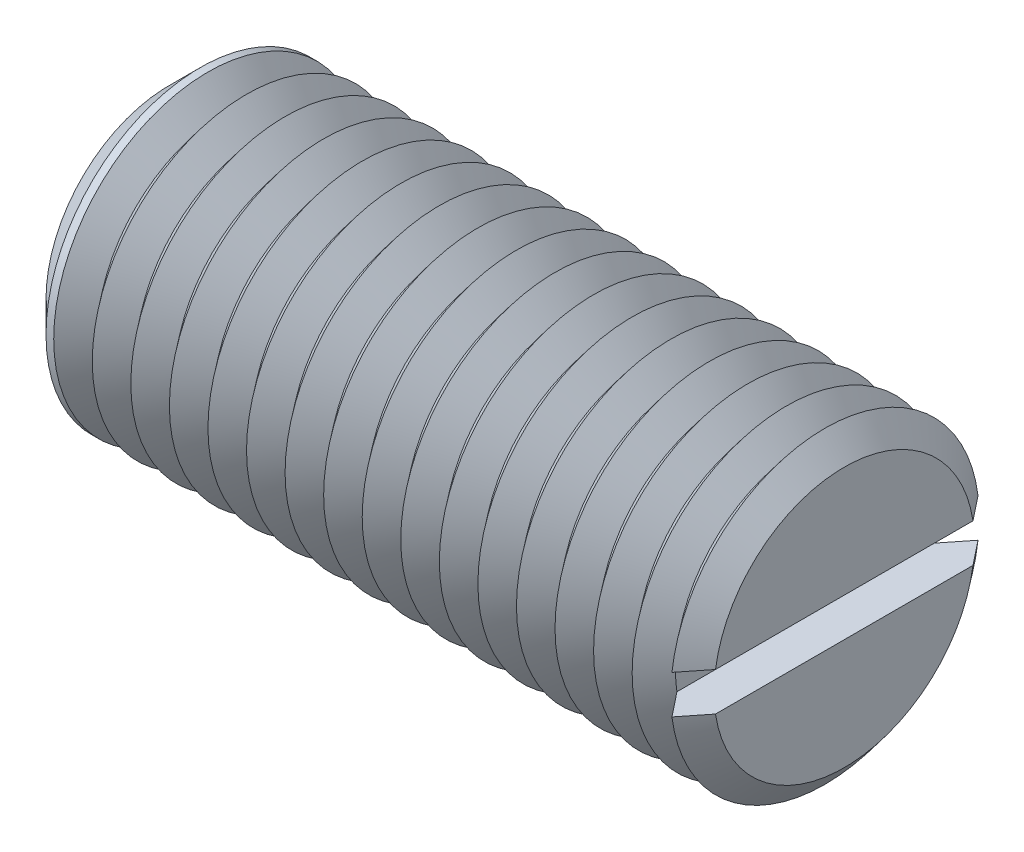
ISO-10303-21;
HEADER;
FILE_DESCRIPTION(('STEP AP214'),'2;1');
FILE_NAME('part.step','',(''),(''),'','','');
FILE_SCHEMA(('AUTOMOTIVE_DESIGN { 1 0 10303 214 1 1 1 1 }'));
ENDSEC;
DATA;
#1=APPLICATION_CONTEXT('core data for automotive mechanical design processes');
#2=APPLICATION_PROTOCOL_DEFINITION('international standard','automotive_design',2000,#1);
#3=PRODUCT_CONTEXT('',#1,'mechanical');
#4=PRODUCT('Part','Part','',(#3));
#5=PRODUCT_RELATED_PRODUCT_CATEGORY('part','',(#4));
#6=PRODUCT_DEFINITION_FORMATION('','',#4);
#7=PRODUCT_DEFINITION_CONTEXT('part definition',#1,'design');
#8=PRODUCT_DEFINITION('design','',#6,#7);
#9=PRODUCT_DEFINITION_SHAPE('','',#8);
#10=(LENGTH_UNIT() NAMED_UNIT(*) SI_UNIT(.MILLI.,.METRE.));
#11=(NAMED_UNIT(*) PLANE_ANGLE_UNIT() SI_UNIT($,.RADIAN.));
#12=(NAMED_UNIT(*) SI_UNIT($,.STERADIAN.) SOLID_ANGLE_UNIT());
#13=UNCERTAINTY_MEASURE_WITH_UNIT(LENGTH_MEASURE(1.E-05),#10,'distance_accuracy_value','');
#14=(GEOMETRIC_REPRESENTATION_CONTEXT(3) GLOBAL_UNCERTAINTY_ASSIGNED_CONTEXT((#13)) GLOBAL_UNIT_ASSIGNED_CONTEXT((#10,
#11,#12)) REPRESENTATION_CONTEXT('',''));
#15=CARTESIAN_POINT('',(0.,0.,0.));
#16=DIRECTION('',(0.,0.,1.));
#17=DIRECTION('',(1.,0.,0.));
#18=AXIS2_PLACEMENT_3D('',#15,#16,#17);
#19=CARTESIAN_POINT('',(16.5,0.,0.));
#20=DIRECTION('',(1.,0.,0.));
#21=DIRECTION('',(0.,0.,-1.));
#22=AXIS2_PLACEMENT_3D('',#19,#20,#21);
#23=CONICAL_SURFACE('',#22,8.,0.895664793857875);
#24=CARTESIAN_POINT('',(16.5,0.,0.));
#25=DIRECTION('',(-1.,0.,0.));
#26=DIRECTION('',(0.,0.,1.));
#27=AXIS2_PLACEMENT_3D('',#24,#25,#26);
#28=CIRCLE('',#27,8.);
#29=CARTESIAN_POINT('',(16.5,-1.,-7.93725393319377));
#30=VERTEX_POINT('',#29);
#31=CARTESIAN_POINT('',(16.5,-1.,7.93725393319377));
#32=VERTEX_POINT('',#31);
#33=EDGE_CURVE('E117',#30,#32,#28,.T.);
#34=ORIENTED_EDGE('',*,*,#33,.T.);
#35=CARTESIAN_POINT('',(24.1137872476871,-1.,-17.4810381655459));
#36=CARTESIAN_POINT('',(23.5731000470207,-1.,-16.8046018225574));
#37=CARTESIAN_POINT('',(23.0324624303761,-1.,-16.1281258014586));
#38=CARTESIAN_POINT('',(21.9513425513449,-1.,-14.7749910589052));
#39=CARTESIAN_POINT('',(21.4108602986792,-1.,-14.0983323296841));
#40=CARTESIAN_POINT('',(20.3295593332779,-1.,-12.7440423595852));
#41=CARTESIAN_POINT('',(19.7887409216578,-1.,-12.0664108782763));
#42=CARTESIAN_POINT('',(18.707566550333,-1.,-10.7108366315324));
#43=CARTESIAN_POINT('',(18.1672105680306,-1.,-10.0328938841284));
#44=CARTESIAN_POINT('',(17.3866021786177,-1.,-9.05235403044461));
#45=CARTESIAN_POINT('',(17.1460332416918,-1.,-8.75000893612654));
#46=CARTESIAN_POINT('',(16.6651110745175,-1.,-8.14514467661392));
#47=CARTESIAN_POINT('',(16.4247578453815,-1.,-7.84262551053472));
#48=CARTESIAN_POINT('',(15.9443170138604,-1.,-7.23730074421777));
#49=CARTESIAN_POINT('',(15.7042294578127,-1.,-6.93449510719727));
#50=CARTESIAN_POINT('',(15.2244992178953,-1.,-6.32854042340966));
#51=CARTESIAN_POINT('',(14.9848565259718,-1.,-6.02539138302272));
#52=CARTESIAN_POINT('',(14.5064209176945,-1.,-5.41876829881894));
#53=CARTESIAN_POINT('',(14.2676275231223,-1.,-5.11529463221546));
#54=CARTESIAN_POINT('',(13.791132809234,-1.,-4.50745556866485));
#55=CARTESIAN_POINT('',(13.5534315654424,-1.,-4.20309011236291));
#56=CARTESIAN_POINT('',(13.1984723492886,-1.,-3.74537358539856));
#57=CARTESIAN_POINT('',(13.0804342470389,-1.,-3.59262786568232));
#58=CARTESIAN_POINT('',(12.8451171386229,-1.,-3.28655323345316));
#59=CARTESIAN_POINT('',(12.7278381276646,-1.,-3.13322432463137));
#60=CARTESIAN_POINT('',(12.4944317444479,-1.,-2.82571819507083));
#61=CARTESIAN_POINT('',(12.3783042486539,-1.,-2.67154106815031));
#62=CARTESIAN_POINT('',(12.1478553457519,-1.,-2.36184450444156));
#63=CARTESIAN_POINT('',(12.0335338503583,-1.,-2.20632513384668));
#64=CARTESIAN_POINT('',(11.8956998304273,-1.,-2.01476175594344));
#65=CARTESIAN_POINT('',(11.8706709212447,-1.,-1.97980928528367));
#66=CARTESIAN_POINT('',(11.8208007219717,-1.,-1.90977040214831));
#67=CARTESIAN_POINT('',(11.7959594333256,-1.,-1.87468398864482));
#68=CARTESIAN_POINT('',(11.7217527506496,-1.,-1.76919140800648));
#69=CARTESIAN_POINT('',(11.6727089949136,-1.,-1.69855807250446));
#70=CARTESIAN_POINT('',(11.5751159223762,-1.,-1.55549554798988));
#71=CARTESIAN_POINT('',(11.5265831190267,-1.,-1.48305505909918));
#72=CARTESIAN_POINT('',(11.4312399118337,-1.,-1.33706835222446));
#73=CARTESIAN_POINT('',(11.3844290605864,-1.,-1.26352242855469));
#74=CARTESIAN_POINT('',(11.2926759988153,-1.,-1.1137948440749));
#75=CARTESIAN_POINT('',(11.2477706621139,-1.,-1.03759043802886));
#76=CARTESIAN_POINT('',(11.161907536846,-1.,-0.882780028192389));
#77=CARTESIAN_POINT('',(11.1209558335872,-1.,-0.804170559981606));
#78=CARTESIAN_POINT('',(11.06478469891,-1.,-0.684500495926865));
#79=CARTESIAN_POINT('',(11.0470539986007,-1.,-0.644631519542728));
#80=CARTESIAN_POINT('',(11.0136729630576,-1.,-0.564036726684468));
#81=CARTESIAN_POINT('',(10.9980230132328,-1.,-0.523310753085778));
#82=CARTESIAN_POINT('',(10.9551526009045,-1.,-0.399956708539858));
#83=CARTESIAN_POINT('',(10.9318433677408,-1.,-0.315816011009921));
#84=CARTESIAN_POINT('',(10.9098657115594,-1.,-0.193542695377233));
#85=CARTESIAN_POINT('',(10.9047261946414,-1.,-0.156548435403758));
#86=CARTESIAN_POINT('',(10.8976757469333,-1.,-0.0822397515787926));
#87=CARTESIAN_POINT('',(10.8957650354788,-1.,-0.0449253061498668));
#88=CARTESIAN_POINT('',(10.8953106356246,-1.,0.0296935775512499));
#89=CARTESIAN_POINT('',(10.8967642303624,-1.,0.0669979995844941));
#90=CARTESIAN_POINT('',(10.902929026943,-1.,0.141334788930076));
#91=CARTESIAN_POINT('',(10.9076406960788,-1.,0.178367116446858));
#92=CARTESIAN_POINT('',(10.9224195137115,-1.,0.266117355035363));
#93=CARTESIAN_POINT('',(10.9338513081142,-1.,0.31660498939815));
#94=CARTESIAN_POINT('',(10.961310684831,-1.,0.416309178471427));
#95=CARTESIAN_POINT('',(10.9773414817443,-1.,0.465524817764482));
#96=CARTESIAN_POINT('',(11.0130409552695,-1.,0.56304966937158));
#97=CARTESIAN_POINT('',(11.0327381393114,-1.,0.611348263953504));
#98=CARTESIAN_POINT('',(11.0747706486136,-1.,0.706748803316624));
#99=CARTESIAN_POINT('',(11.0971051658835,-1.,0.75385110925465));
#100=CARTESIAN_POINT('',(11.1464135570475,-1.,0.852405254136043));
#101=CARTESIAN_POINT('',(11.1736257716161,-1.,0.903736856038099));
#102=CARTESIAN_POINT('',(11.2298407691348,-1.,1.00541472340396));
#103=CARTESIAN_POINT('',(11.2588439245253,-1.,1.05576078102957));
#104=CARTESIAN_POINT('',(11.3478642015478,-1.,1.20570300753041));
#105=CARTESIAN_POINT('',(11.409851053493,-1.,1.30412495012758));
#106=CARTESIAN_POINT('',(11.5370218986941,-1.,1.4992147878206));
#107=CARTESIAN_POINT('',(11.6022138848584,-1.,1.59587737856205));
#108=CARTESIAN_POINT('',(11.734509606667,-1.,1.78781770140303));
#109=CARTESIAN_POINT('',(11.8016124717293,-1.,1.88309603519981));
#110=CARTESIAN_POINT('',(11.9371969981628,-1.,2.07285006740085));
#111=CARTESIAN_POINT('',(12.0056803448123,-1.,2.16732455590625));
#112=CARTESIAN_POINT('',(12.1435598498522,-1.,2.35561985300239));
#113=CARTESIAN_POINT('',(12.2129561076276,-1.,2.4494405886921));
#114=CARTESIAN_POINT('',(12.3522867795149,-1.,2.63643541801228));
#115=CARTESIAN_POINT('',(12.4222200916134,-1.,2.72961033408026));
#116=CARTESIAN_POINT('',(12.5625737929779,-1.,2.91558674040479));
#117=CARTESIAN_POINT('',(12.6329941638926,-1.,3.00838824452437));
#118=CARTESIAN_POINT('',(12.8434401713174,-1.,3.28457080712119));
#119=CARTESIAN_POINT('',(12.9840068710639,-1.,3.46753938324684));
#120=CARTESIAN_POINT('',(13.266047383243,-1.,3.83277652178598));
#121=CARTESIAN_POINT('',(13.4075212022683,-1.,4.0150450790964));
#122=CARTESIAN_POINT('',(13.832844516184,-1.,4.56116633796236));
#123=CARTESIAN_POINT('',(14.1175870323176,-1.,4.92432312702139));
#124=CARTESIAN_POINT('',(14.688450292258,-1.,5.64994266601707));
#125=CARTESIAN_POINT('',(14.974571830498,-1.,6.01240478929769));
#126=CARTESIAN_POINT('',(15.5475166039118,-1.,6.73676512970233));
#127=CARTESIAN_POINT('',(15.834339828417,-1.,7.09866335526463));
#128=CARTESIAN_POINT('',(16.4076446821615,-1.,7.82112227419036));
#129=CARTESIAN_POINT('',(16.694125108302,-1.,8.18168392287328));
#130=CARTESIAN_POINT('',(17.2673842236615,-1.,8.90257236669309));
#131=CARTESIAN_POINT('',(17.5541629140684,-1.,9.2628991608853));
#132=CARTESIAN_POINT('',(18.4146958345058,-1.,10.3434977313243));
#133=CARTESIAN_POINT('',(18.9887564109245,-1.,11.0635255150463));
#134=CARTESIAN_POINT('',(19.9416309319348,-1.,12.2579358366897));
#135=CARTESIAN_POINT('',(20.3203198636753,-1.,12.7324181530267));
#136=CARTESIAN_POINT('',(21.077860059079,-1.,13.6812951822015));
#137=CARTESIAN_POINT('',(21.4567113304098,-1.,14.1556898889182));
#138=CARTESIAN_POINT('',(22.2152320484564,-1.,15.1052923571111));
#139=CARTESIAN_POINT('',(22.5949016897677,-1.,15.5804999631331));
#140=CARTESIAN_POINT('',(23.3543004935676,-1.,16.5308253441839));
#141=CARTESIAN_POINT('',(23.7340296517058,-1.,17.005943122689));
#142=CARTESIAN_POINT('',(24.1137872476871,-1.,17.4810381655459));
#143=B_SPLINE_CURVE_WITH_KNOTS('',3,(#35,#36,#37,#38,#39,#40,#41,#42,#43,#44,#45,#46,#47,#48,
#49,#50,#51,#52,#53,#54,#55,#56,#57,#58,#59,#60,#61,#62,#63,#64,#65,#66,#67,#68,#69,#70,#71,#72,
#73,#74,#75,#76,#77,#78,#79,#80,#81,#82,#83,#84,#85,#86,#87,#88,#89,#90,#91,#92,#93,#94,#95,#96,
#97,#98,#99,#100,#101,#102,#103,#104,#105,#106,#107,#108,#109,#110,#111,#112,#113,#114,#115,
#116,#117,#118,#119,#120,#121,#122,#123,#124,#125,#126,#127,#128,#129,#130,#131,#132,#133,#134,
#135,#136,#137,#138,#139,#140,#141,#142),.UNSPECIFIED.,.F.,.F.,(4,2,2,2,2,2,2,2,2,2,2,2,2,2,2,2,
2,2,2,2,2,2,2,2,2,2,2,2,2,2,2,2,2,2,2,2,2,2,2,2,2,2,2,2,2,2,2,2,2,2,2,2,2,4),(0.,
2.59791825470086,5.19597381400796,7.79693910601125,10.3977690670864,11.5568952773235,
12.7160274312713,13.8753371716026,15.0346257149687,16.1931009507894,17.3516551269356,
17.9307722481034,18.5098857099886,19.0889363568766,19.6679586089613,19.7969273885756,
19.9258971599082,20.1838595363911,20.4454304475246,20.7069329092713,20.9722220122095,
21.2379131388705,21.3687577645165,21.4996265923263,21.7602408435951,21.8721711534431,
21.9841090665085,22.0959566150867,22.2078202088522,22.3628274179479,22.5179432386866,
22.6743197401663,22.8306484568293,23.0048946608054,23.1791772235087,23.5280071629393,
23.8777561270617,24.2273482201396,24.5773965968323,24.927483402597,25.2769811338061,
25.6264657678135,26.3186514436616,27.0108421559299,28.3952670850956,29.7806179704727,
31.1659479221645,32.5474981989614,33.9290539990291,36.6916375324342,38.5128593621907,
40.334179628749,42.1589376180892,43.9835965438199),.UNSPECIFIED.);
#144=CARTESIAN_POINT('',(15.5,-1.,6.67652652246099));
#145=VERTEX_POINT('',#144);
#146=EDGE_CURVE('E109',#145,#32,#143,.T.);
#147=ORIENTED_EDGE('',*,*,#146,.F.);
#148=CARTESIAN_POINT('',(15.5,0.,0.));
#149=DIRECTION('',(-1.,0.,0.));
#150=DIRECTION('',(0.,0.,1.));
#151=AXIS2_PLACEMENT_3D('',#148,#149,#150);
#152=CIRCLE('',#151,6.75100040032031);
#153=CARTESIAN_POINT('',(15.5,-1.,-6.67652652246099));
#154=VERTEX_POINT('',#153);
#155=EDGE_CURVE('E352',#154,#145,#152,.T.);
#156=ORIENTED_EDGE('',*,*,#155,.F.);
#157=EDGE_CURVE('E58',#30,#154,#143,.T.);
#158=ORIENTED_EDGE('',*,*,#157,.F.);
#159=EDGE_LOOP('',(#34,#147,#156,#158));
#160=FACE_BOUND('',#159,.T.);
#161=ADVANCED_FACE('F37',(#160),#23,.T.);
#162=CARTESIAN_POINT('',(16.5,1.,7.93725393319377));
#163=VERTEX_POINT('',#162);
#164=CARTESIAN_POINT('',(16.5,1.,-7.93725393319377));
#165=VERTEX_POINT('',#164);
#166=EDGE_CURVE('E100',#163,#165,#28,.T.);
#167=ORIENTED_EDGE('',*,*,#166,.T.);
#168=CARTESIAN_POINT('',(24.1137872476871,1.,17.4810381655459));
#169=CARTESIAN_POINT('',(23.5731000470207,1.,16.8046018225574));
#170=CARTESIAN_POINT('',(23.0324624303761,1.,16.1281258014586));
#171=CARTESIAN_POINT('',(21.9513425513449,1.,14.7749910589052));
#172=CARTESIAN_POINT('',(21.4108602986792,1.,14.0983323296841));
#173=CARTESIAN_POINT('',(20.3295593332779,1.,12.7440423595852));
#174=CARTESIAN_POINT('',(19.7887409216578,1.,12.0664108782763));
#175=CARTESIAN_POINT('',(18.707566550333,1.,10.7108366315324));
#176=CARTESIAN_POINT('',(18.1672105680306,1.,10.0328938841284));
#177=CARTESIAN_POINT('',(17.3866021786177,1.,9.05235403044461));
#178=CARTESIAN_POINT('',(17.1460332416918,1.,8.75000893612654));
#179=CARTESIAN_POINT('',(16.6651110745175,1.,8.14514467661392));
#180=CARTESIAN_POINT('',(16.4247578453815,1.,7.84262551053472));
#181=CARTESIAN_POINT('',(15.9443170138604,1.,7.23730074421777));
#182=CARTESIAN_POINT('',(15.7042294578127,1.,6.93449510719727));
#183=CARTESIAN_POINT('',(15.2244992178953,1.,6.32854042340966));
#184=CARTESIAN_POINT('',(14.9848565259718,1.,6.02539138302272));
#185=CARTESIAN_POINT('',(14.5064209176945,1.,5.41876829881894));
#186=CARTESIAN_POINT('',(14.2676275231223,1.,5.11529463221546));
#187=CARTESIAN_POINT('',(13.791132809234,1.,4.50745556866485));
#188=CARTESIAN_POINT('',(13.5534315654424,1.,4.20309011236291));
#189=CARTESIAN_POINT('',(13.1984723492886,1.,3.74537358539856));
#190=CARTESIAN_POINT('',(13.0804342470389,1.,3.59262786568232));
#191=CARTESIAN_POINT('',(12.8451171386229,1.,3.28655323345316));
#192=CARTESIAN_POINT('',(12.7278381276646,1.,3.13322432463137));
#193=CARTESIAN_POINT('',(12.4944317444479,1.,2.82571819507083));
#194=CARTESIAN_POINT('',(12.3783042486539,1.,2.67154106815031));
#195=CARTESIAN_POINT('',(12.1478553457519,1.,2.36184450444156));
#196=CARTESIAN_POINT('',(12.0335338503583,1.,2.20632513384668));
#197=CARTESIAN_POINT('',(11.8956998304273,1.,2.01476175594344));
#198=CARTESIAN_POINT('',(11.8706709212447,1.,1.97980928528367));
#199=CARTESIAN_POINT('',(11.8208007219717,1.,1.90977040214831));
#200=CARTESIAN_POINT('',(11.7959594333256,1.,1.87468398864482));
#201=CARTESIAN_POINT('',(11.7217527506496,1.,1.76919140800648));
#202=CARTESIAN_POINT('',(11.6727089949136,1.,1.69855807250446));
#203=CARTESIAN_POINT('',(11.5751159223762,1.,1.55549554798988));
#204=CARTESIAN_POINT('',(11.5265831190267,1.,1.48305505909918));
#205=CARTESIAN_POINT('',(11.4312399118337,1.,1.33706835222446));
#206=CARTESIAN_POINT('',(11.3844290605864,1.,1.26352242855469));
#207=CARTESIAN_POINT('',(11.2926759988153,1.,1.1137948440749));
#208=CARTESIAN_POINT('',(11.2477706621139,1.,1.03759043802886));
#209=CARTESIAN_POINT('',(11.161907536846,1.,0.882780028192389));
#210=CARTESIAN_POINT('',(11.1209558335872,1.,0.804170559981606));
#211=CARTESIAN_POINT('',(11.06478469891,1.,0.684500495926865));
#212=CARTESIAN_POINT('',(11.0470539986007,1.,0.644631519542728));
#213=CARTESIAN_POINT('',(11.0136729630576,1.,0.564036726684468));
#214=CARTESIAN_POINT('',(10.9980230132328,1.,0.523310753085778));
#215=CARTESIAN_POINT('',(10.9551526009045,1.,0.399956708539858));
#216=CARTESIAN_POINT('',(10.9318433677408,1.,0.315816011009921));
#217=CARTESIAN_POINT('',(10.9098657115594,1.,0.193542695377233));
#218=CARTESIAN_POINT('',(10.9047261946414,1.,0.156548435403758));
#219=CARTESIAN_POINT('',(10.8976757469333,1.,0.0822397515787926));
#220=CARTESIAN_POINT('',(10.8957650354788,1.,0.0449253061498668));
#221=CARTESIAN_POINT('',(10.8953106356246,1.,-0.0296935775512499));
#222=CARTESIAN_POINT('',(10.8967642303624,1.,-0.0669979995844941));
#223=CARTESIAN_POINT('',(10.902929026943,1.,-0.141334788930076));
#224=CARTESIAN_POINT('',(10.9076406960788,1.,-0.178367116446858));
#225=CARTESIAN_POINT('',(10.9224195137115,1.,-0.266117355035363));
#226=CARTESIAN_POINT('',(10.9338513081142,1.,-0.31660498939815));
#227=CARTESIAN_POINT('',(10.961310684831,1.,-0.416309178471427));
#228=CARTESIAN_POINT('',(10.9773414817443,1.,-0.465524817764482));
#229=CARTESIAN_POINT('',(11.0130409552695,1.,-0.56304966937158));
#230=CARTESIAN_POINT('',(11.0327381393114,1.,-0.611348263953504));
#231=CARTESIAN_POINT('',(11.0747706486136,1.,-0.706748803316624));
#232=CARTESIAN_POINT('',(11.0971051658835,1.,-0.75385110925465));
#233=CARTESIAN_POINT('',(11.1464135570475,1.,-0.852405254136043));
#234=CARTESIAN_POINT('',(11.1736257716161,1.,-0.903736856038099));
#235=CARTESIAN_POINT('',(11.2298407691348,1.,-1.00541472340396));
#236=CARTESIAN_POINT('',(11.2588439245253,1.,-1.05576078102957));
#237=CARTESIAN_POINT('',(11.3478642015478,1.,-1.20570300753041));
#238=CARTESIAN_POINT('',(11.409851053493,1.,-1.30412495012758));
#239=CARTESIAN_POINT('',(11.5370218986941,1.,-1.4992147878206));
#240=CARTESIAN_POINT('',(11.6022138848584,1.,-1.59587737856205));
#241=CARTESIAN_POINT('',(11.734509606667,1.,-1.78781770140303));
#242=CARTESIAN_POINT('',(11.8016124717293,1.,-1.88309603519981));
#243=CARTESIAN_POINT('',(11.9371969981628,1.,-2.07285006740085));
#244=CARTESIAN_POINT('',(12.0056803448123,1.,-2.16732455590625));
#245=CARTESIAN_POINT('',(12.1435598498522,1.,-2.35561985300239));
#246=CARTESIAN_POINT('',(12.2129561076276,1.,-2.4494405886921));
#247=CARTESIAN_POINT('',(12.3522867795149,1.,-2.63643541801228));
#248=CARTESIAN_POINT('',(12.4222200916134,1.,-2.72961033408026));
#249=CARTESIAN_POINT('',(12.5625737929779,1.,-2.91558674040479));
#250=CARTESIAN_POINT('',(12.6329941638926,1.,-3.00838824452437));
#251=CARTESIAN_POINT('',(12.8434401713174,1.,-3.28457080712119));
#252=CARTESIAN_POINT('',(12.9840068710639,1.,-3.46753938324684));
#253=CARTESIAN_POINT('',(13.266047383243,1.,-3.83277652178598));
#254=CARTESIAN_POINT('',(13.4075212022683,1.,-4.0150450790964));
#255=CARTESIAN_POINT('',(13.832844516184,1.,-4.56116633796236));
#256=CARTESIAN_POINT('',(14.1175870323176,1.,-4.92432312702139));
#257=CARTESIAN_POINT('',(14.688450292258,1.,-5.64994266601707));
#258=CARTESIAN_POINT('',(14.974571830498,1.,-6.01240478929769));
#259=CARTESIAN_POINT('',(15.5475166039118,1.,-6.73676512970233));
#260=CARTESIAN_POINT('',(15.834339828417,1.,-7.09866335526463));
#261=CARTESIAN_POINT('',(16.4076446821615,1.,-7.82112227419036));
#262=CARTESIAN_POINT('',(16.694125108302,1.,-8.18168392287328));
#263=CARTESIAN_POINT('',(17.2673842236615,1.,-8.90257236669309));
#264=CARTESIAN_POINT('',(17.5541629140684,1.,-9.2628991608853));
#265=CARTESIAN_POINT('',(18.4146958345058,1.,-10.3434977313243));
#266=CARTESIAN_POINT('',(18.9887564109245,1.,-11.0635255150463));
#267=CARTESIAN_POINT('',(19.9416309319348,1.,-12.2579358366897));
#268=CARTESIAN_POINT('',(20.3203198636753,1.,-12.7324181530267));
#269=CARTESIAN_POINT('',(21.077860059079,1.,-13.6812951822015));
#270=CARTESIAN_POINT('',(21.4567113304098,1.,-14.1556898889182));
#271=CARTESIAN_POINT('',(22.2152320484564,1.,-15.1052923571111));
#272=CARTESIAN_POINT('',(22.5949016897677,1.,-15.5804999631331));
#273=CARTESIAN_POINT('',(23.3543004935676,1.,-16.5308253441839));
#274=CARTESIAN_POINT('',(23.7340296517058,1.,-17.005943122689));
#275=CARTESIAN_POINT('',(24.1137872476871,1.,-17.4810381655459));
#276=B_SPLINE_CURVE_WITH_KNOTS('',3,(#168,#169,#170,#171,#172,#173,#174,#175,#176,#177,#178,
#179,#180,#181,#182,#183,#184,#185,#186,#187,#188,#189,#190,#191,#192,#193,#194,#195,#196,#197,
#198,#199,#200,#201,#202,#203,#204,#205,#206,#207,#208,#209,#210,#211,#212,#213,#214,#215,#216,
#217,#218,#219,#220,#221,#222,#223,#224,#225,#226,#227,#228,#229,#230,#231,#232,#233,#234,#235,
#236,#237,#238,#239,#240,#241,#242,#243,#244,#245,#246,#247,#248,#249,#250,#251,#252,#253,#254,
#255,#256,#257,#258,#259,#260,#261,#262,#263,#264,#265,#266,#267,#268,#269,#270,#271,#272,#273,
#274,#275),.UNSPECIFIED.,.F.,.F.,(4,2,2,2,2,2,2,2,2,2,2,2,2,2,2,2,2,2,2,2,2,2,2,2,2,2,2,2,2,2,2,
2,2,2,2,2,2,2,2,2,2,2,2,2,2,2,2,2,2,2,2,2,2,4),(0.,2.59791825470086,5.19597381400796,
7.79693910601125,10.3977690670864,11.5568952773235,12.7160274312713,13.8753371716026,
15.0346257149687,16.1931009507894,17.3516551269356,17.9307722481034,18.5098857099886,
19.0889363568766,19.6679586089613,19.7969273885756,19.9258971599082,20.1838595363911,
20.4454304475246,20.7069329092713,20.9722220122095,21.2379131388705,21.3687577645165,
21.4996265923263,21.7602408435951,21.8721711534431,21.9841090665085,22.0959566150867,
22.2078202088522,22.3628274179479,22.5179432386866,22.6743197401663,22.8306484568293,
23.0048946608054,23.1791772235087,23.5280071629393,23.8777561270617,24.2273482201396,
24.5773965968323,24.927483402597,25.2769811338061,25.6264657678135,26.3186514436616,
27.0108421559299,28.3952670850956,29.7806179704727,31.1659479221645,32.5474981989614,
33.9290539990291,36.6916375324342,38.5128593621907,40.334179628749,42.1589376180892,
43.9835965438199),.UNSPECIFIED.);
#277=CARTESIAN_POINT('',(15.5,1.,-6.67652652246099));
#278=VERTEX_POINT('',#277);
#279=EDGE_CURVE('E110',#278,#165,#276,.T.);
#280=ORIENTED_EDGE('',*,*,#279,.F.);
#281=CARTESIAN_POINT('',(15.5,1.,6.67652652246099));
#282=VERTEX_POINT('',#281);
#283=EDGE_CURVE('E103',#282,#278,#152,.T.);
#284=ORIENTED_EDGE('',*,*,#283,.F.);
#285=EDGE_CURVE('E97',#163,#282,#276,.T.);
#286=ORIENTED_EDGE('',*,*,#285,.F.);
#287=EDGE_LOOP('',(#167,#280,#284,#286));
#288=FACE_BOUND('',#287,.T.);
#289=ADVANCED_FACE('F99',(#288),#23,.T.);
#290=CARTESIAN_POINT('',(15.5,0.,0.));
#291=DIRECTION('',(-1.,0.,0.));
#292=DIRECTION('',(0.,0.,1.));
#293=AXIS2_PLACEMENT_3D('',#290,#291,#292);
#294=CONICAL_SURFACE('',#293,6.75100040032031,0.895664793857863);
#295=CARTESIAN_POINT('',(14.5,0.,0.));
#296=DIRECTION('',(-1.,0.,0.));
#297=DIRECTION('',(0.,0.,1.));
#298=AXIS2_PLACEMENT_3D('',#295,#296,#297);
#299=CIRCLE('',#298,8.);
#300=CARTESIAN_POINT('',(14.5,0.,8.));
#301=VERTEX_POINT('',#300);
#302=EDGE_CURVE('E340',#301,#301,#299,.T.);
#303=ORIENTED_EDGE('',*,*,#302,.F.);
#304=EDGE_LOOP('',(#303));
#305=FACE_BOUND('',#304,.T.);
#306=ORIENTED_EDGE('',*,*,#283,.T.);
#307=EDGE_CURVE('E347',#278,#154,#152,.T.);
#308=ORIENTED_EDGE('',*,*,#307,.T.);
#309=ORIENTED_EDGE('',*,*,#155,.T.);
#310=EDGE_CURVE('E346',#145,#282,#152,.T.);
#311=ORIENTED_EDGE('',*,*,#310,.T.);
#312=EDGE_LOOP('',(#306,#308,#309,#311));
#313=FACE_BOUND('',#312,.T.);
#314=ADVANCED_FACE('F166',(#305,#313),#294,.T.);
#315=CARTESIAN_POINT('',(17.5,0.,0.));
#316=DIRECTION('',(1.,0.,0.));
#317=DIRECTION('',(0.,0.,-1.));
#318=AXIS2_PLACEMENT_3D('',#315,#316,#317);
#319=PLANE('',#318);
#320=CARTESIAN_POINT('',(17.5,0.,0.));
#321=DIRECTION('',(-1.,0.,0.));
#322=DIRECTION('',(0.,0.,1.));
#323=AXIS2_PLACEMENT_3D('',#320,#321,#322);
#324=CIRCLE('',#323,6.75100040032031);
#325=CARTESIAN_POINT('',(17.5,1.,6.67652652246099));
#326=VERTEX_POINT('',#325);
#327=CARTESIAN_POINT('',(17.5,1.,-6.67652652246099));
#328=VERTEX_POINT('',#327);
#329=EDGE_CURVE('E158',#326,#328,#324,.T.);
#330=ORIENTED_EDGE('',*,*,#329,.F.);
#331=DIRECTION('',(0.,0.,1.));
#332=VECTOR('',#331,1.);
#333=CARTESIAN_POINT('',(17.5,1.,0.));
#334=LINE('',#333,#332);
#335=EDGE_CURVE('E122',#328,#326,#334,.T.);
#336=ORIENTED_EDGE('',*,*,#335,.F.);
#337=EDGE_LOOP('',(#330,#336));
#338=FACE_BOUND('',#337,.T.);
#339=ADVANCED_FACE('F170',(#338),#319,.T.);
#340=CARTESIAN_POINT('',(17.5,-1.,-6.67652652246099));
#341=VERTEX_POINT('',#340);
#342=CARTESIAN_POINT('',(17.5,-1.,6.67652652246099));
#343=VERTEX_POINT('',#342);
#344=EDGE_CURVE('E66',#341,#343,#324,.T.);
#345=ORIENTED_EDGE('',*,*,#344,.F.);
#346=DIRECTION('',(0.,0.,-1.));
#347=VECTOR('',#346,1.);
#348=CARTESIAN_POINT('',(17.5,-1.,0.));
#349=LINE('',#348,#347);
#350=EDGE_CURVE('E134',#343,#341,#349,.T.);
#351=ORIENTED_EDGE('',*,*,#350,.F.);
#352=EDGE_LOOP('',(#345,#351));
#353=FACE_BOUND('',#352,.T.);
#354=ADVANCED_FACE('F200',(#353),#319,.T.);
#355=CARTESIAN_POINT('',(17.5,0.,0.));
#356=DIRECTION('',(-1.,0.,0.));
#357=DIRECTION('',(0.,0.,1.));
#358=AXIS2_PLACEMENT_3D('',#355,#356,#357);
#359=CONICAL_SURFACE('',#358,6.75100040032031,0.895664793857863);
#360=ORIENTED_EDGE('',*,*,#166,.F.);
#361=CARTESIAN_POINT('',(8.88621275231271,1.,-17.4810381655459));
#362=CARTESIAN_POINT('',(9.42689995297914,1.,-16.8046018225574));
#363=CARTESIAN_POINT('',(9.96753756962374,1.,-16.1281258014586));
#364=CARTESIAN_POINT('',(11.0486574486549,1.,-14.7749910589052));
#365=CARTESIAN_POINT('',(11.5891397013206,1.,-14.0983323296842));
#366=CARTESIAN_POINT('',(12.6704406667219,1.,-12.7440423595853));
#367=CARTESIAN_POINT('',(13.211259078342,1.,-12.0664108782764));
#368=CARTESIAN_POINT('',(14.2924334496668,1.,-10.7108366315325));
#369=CARTESIAN_POINT('',(14.8327894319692,1.,-10.0328938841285));
#370=CARTESIAN_POINT('',(15.6133978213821,1.,-9.05235403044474));
#371=CARTESIAN_POINT('',(15.8539667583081,1.,-8.75000893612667));
#372=CARTESIAN_POINT('',(16.3348889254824,1.,-8.14514467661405));
#373=CARTESIAN_POINT('',(16.5752421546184,1.,-7.84262551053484));
#374=CARTESIAN_POINT('',(17.0556829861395,1.,-7.23730074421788));
#375=CARTESIAN_POINT('',(17.2957705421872,1.,-6.93449510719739));
#376=CARTESIAN_POINT('',(17.7755007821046,1.,-6.32854042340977));
#377=CARTESIAN_POINT('',(18.0151434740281,1.,-6.02539138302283));
#378=CARTESIAN_POINT('',(18.4935790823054,1.,-5.41876829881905));
#379=CARTESIAN_POINT('',(18.7323724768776,1.,-5.11529463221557));
#380=CARTESIAN_POINT('',(19.208867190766,1.,-4.50745556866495));
#381=CARTESIAN_POINT('',(19.4465684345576,1.,-4.20309011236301));
#382=CARTESIAN_POINT('',(19.8015276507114,1.,-3.74537358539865));
#383=CARTESIAN_POINT('',(19.919565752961,1.,-3.59262786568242));
#384=CARTESIAN_POINT('',(20.1548828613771,1.,-3.28655323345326));
#385=CARTESIAN_POINT('',(20.2721618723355,1.,-3.13322432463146));
#386=CARTESIAN_POINT('',(20.5055682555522,1.,-2.82571819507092));
#387=CARTESIAN_POINT('',(20.6216957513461,1.,-2.67154106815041));
#388=CARTESIAN_POINT('',(20.8521446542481,1.,-2.36184450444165));
#389=CARTESIAN_POINT('',(20.9664661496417,1.,-2.20632513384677));
#390=CARTESIAN_POINT('',(21.1043001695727,1.,-2.01476175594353));
#391=CARTESIAN_POINT('',(21.1293290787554,1.,-1.97980928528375));
#392=CARTESIAN_POINT('',(21.1791992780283,1.,-1.90977040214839));
#393=CARTESIAN_POINT('',(21.2040405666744,1.,-1.87468398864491));
#394=CARTESIAN_POINT('',(21.2782472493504,1.,-1.76919140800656));
#395=CARTESIAN_POINT('',(21.3272910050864,1.,-1.69855807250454));
#396=CARTESIAN_POINT('',(21.4248840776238,1.,-1.55549554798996));
#397=CARTESIAN_POINT('',(21.4734168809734,1.,-1.48305505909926));
#398=CARTESIAN_POINT('',(21.5687600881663,1.,-1.33706835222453));
#399=CARTESIAN_POINT('',(21.6155709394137,1.,-1.26352242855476));
#400=CARTESIAN_POINT('',(21.7073240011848,1.,-1.11379484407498));
#401=CARTESIAN_POINT('',(21.7522293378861,1.,-1.03759043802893));
#402=CARTESIAN_POINT('',(21.838092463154,1.,-0.882780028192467));
#403=CARTESIAN_POINT('',(21.8790441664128,1.,-0.804170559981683));
#404=CARTESIAN_POINT('',(21.9352153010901,1.,-0.684500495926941));
#405=CARTESIAN_POINT('',(21.9529460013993,1.,-0.644631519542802));
#406=CARTESIAN_POINT('',(21.9863270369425,1.,-0.564036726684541));
#407=CARTESIAN_POINT('',(22.0019769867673,1.,-0.523310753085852));
#408=CARTESIAN_POINT('',(22.0448473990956,1.,-0.399956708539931));
#409=CARTESIAN_POINT('',(22.0681566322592,1.,-0.315816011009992));
#410=CARTESIAN_POINT('',(22.0901342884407,1.,-0.193542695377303));
#411=CARTESIAN_POINT('',(22.0952738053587,1.,-0.15654843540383));
#412=CARTESIAN_POINT('',(22.1023242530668,1.,-0.0822397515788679));
#413=CARTESIAN_POINT('',(22.1042349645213,1.,-0.0449253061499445));
#414=CARTESIAN_POINT('',(22.1046893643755,1.,0.0296935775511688));
#415=CARTESIAN_POINT('',(22.1032357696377,1.,0.0669979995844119));
#416=CARTESIAN_POINT('',(22.0970709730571,1.,0.141334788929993));
#417=CARTESIAN_POINT('',(22.0923593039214,1.,0.178367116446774));
#418=CARTESIAN_POINT('',(22.0775804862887,1.,0.266117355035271));
#419=CARTESIAN_POINT('',(22.0661486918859,1.,0.316604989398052));
#420=CARTESIAN_POINT('',(22.0386893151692,1.,0.416309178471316));
#421=CARTESIAN_POINT('',(22.0226585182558,1.,0.465524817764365));
#422=CARTESIAN_POINT('',(21.9869590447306,1.,0.563049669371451));
#423=CARTESIAN_POINT('',(21.9672618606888,1.,0.611348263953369));
#424=CARTESIAN_POINT('',(21.9252293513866,1.,0.706748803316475));
#425=CARTESIAN_POINT('',(21.9028948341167,1.,0.753851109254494));
#426=CARTESIAN_POINT('',(21.8535864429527,1.,0.85240525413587));
#427=CARTESIAN_POINT('',(21.8263742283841,1.,0.903736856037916));
#428=CARTESIAN_POINT('',(21.7701592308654,1.,1.00541472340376));
#429=CARTESIAN_POINT('',(21.7411560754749,1.,1.05576078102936));
#430=CARTESIAN_POINT('',(21.6521357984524,1.,1.20570300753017));
#431=CARTESIAN_POINT('',(21.5901489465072,1.,1.30412495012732));
#432=CARTESIAN_POINT('',(21.4629781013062,1.,1.4992147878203));
#433=CARTESIAN_POINT('',(21.3977861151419,1.,1.59587737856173));
#434=CARTESIAN_POINT('',(21.2654903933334,1.,1.78781770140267));
#435=CARTESIAN_POINT('',(21.198387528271,1.,1.88309603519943));
#436=CARTESIAN_POINT('',(21.0628030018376,1.,2.07285006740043));
#437=CARTESIAN_POINT('',(20.9943196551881,1.,2.16732455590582));
#438=CARTESIAN_POINT('',(20.8564401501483,1.,2.35561985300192));
#439=CARTESIAN_POINT('',(20.7870438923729,1.,2.44944058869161));
#440=CARTESIAN_POINT('',(20.6477132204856,1.,2.63643541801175));
#441=CARTESIAN_POINT('',(20.577779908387,1.,2.72961033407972));
#442=CARTESIAN_POINT('',(20.4374262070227,1.,2.9155867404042));
#443=CARTESIAN_POINT('',(20.3670058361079,1.,3.00838824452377));
#444=CARTESIAN_POINT('',(20.1565598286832,1.,3.28457080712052));
#445=CARTESIAN_POINT('',(20.0159931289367,1.,3.46753938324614));
#446=CARTESIAN_POINT('',(19.7339526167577,1.,3.8327765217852));
#447=CARTESIAN_POINT('',(19.5924787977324,1.,4.01504507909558));
#448=CARTESIAN_POINT('',(19.1671554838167,1.,4.56116633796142));
#449=CARTESIAN_POINT('',(18.8824129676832,1.,4.92432312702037));
#450=CARTESIAN_POINT('',(18.311549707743,1.,5.64994266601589));
#451=CARTESIAN_POINT('',(18.025428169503,1.,6.01240478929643));
#452=CARTESIAN_POINT('',(17.4524833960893,1.,6.73676512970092));
#453=CARTESIAN_POINT('',(17.1656601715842,1.,7.09866335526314));
#454=CARTESIAN_POINT('',(16.5923553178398,1.,7.82112227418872));
#455=CARTESIAN_POINT('',(16.3058748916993,1.,8.18168392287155));
#456=CARTESIAN_POINT('',(15.7326157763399,1.,8.9025723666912));
#457=CARTESIAN_POINT('',(15.4458370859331,1.,9.26289916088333));
#458=CARTESIAN_POINT('',(14.5853041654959,1.,10.3434977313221));
#459=CARTESIAN_POINT('',(14.0112435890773,1.,11.0635255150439));
#460=CARTESIAN_POINT('',(13.058369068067,1.,12.2579358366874));
#461=CARTESIAN_POINT('',(12.6796801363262,1.,12.7324181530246));
#462=CARTESIAN_POINT('',(11.9221399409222,1.,13.6812951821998));
#463=CARTESIAN_POINT('',(11.5432886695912,1.,14.1556898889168));
#464=CARTESIAN_POINT('',(10.7847679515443,1.,15.10529235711));
#465=CARTESIAN_POINT('',(10.4050983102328,1.,15.5804999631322));
#466=CARTESIAN_POINT('',(9.64569950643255,1.,16.5308253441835));
#467=CARTESIAN_POINT('',(9.26597034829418,1.,17.0059431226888));
#468=CARTESIAN_POINT('',(8.88621275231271,1.,17.4810381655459));
#469=B_SPLINE_CURVE_WITH_KNOTS('',3,(#361,#362,#363,#364,#365,#366,#367,#368,#369,#370,#371,
#372,#373,#374,#375,#376,#377,#378,#379,#380,#381,#382,#383,#384,#385,#386,#387,#388,#389,#390,
#391,#392,#393,#394,#395,#396,#397,#398,#399,#400,#401,#402,#403,#404,#405,#406,#407,#408,#409,
#410,#411,#412,#413,#414,#415,#416,#417,#418,#419,#420,#421,#422,#423,#424,#425,#426,#427,#428,
#429,#430,#431,#432,#433,#434,#435,#436,#437,#438,#439,#440,#441,#442,#443,#444,#445,#446,#447,
#448,#449,#450,#451,#452,#453,#454,#455,#456,#457,#458,#459,#460,#461,#462,#463,#464,#465,#466,
#467,#468),.UNSPECIFIED.,.F.,.F.,(4,2,2,2,2,2,2,2,2,2,2,2,2,2,2,2,2,2,2,2,2,2,2,2,2,2,2,2,2,2,2,
2,2,2,2,2,2,2,2,2,2,2,2,2,2,2,2,2,2,2,2,2,2,4),(0.,2.59791825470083,5.19597381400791,
7.79693910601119,10.3977690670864,11.5568952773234,12.7160274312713,13.8753371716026,
15.0346257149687,16.1931009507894,17.3516551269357,17.9307722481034,18.5098857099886,
19.0889363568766,19.6679586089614,19.7969273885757,19.9258971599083,20.1838595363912,
20.4454304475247,20.7069329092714,20.9722220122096,21.2379131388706,21.3687577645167,
21.4996265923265,21.7602408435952,21.8721711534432,21.9841090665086,22.0959566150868,
22.2078202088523,22.362827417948,22.5179432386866,22.6743197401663,22.8306484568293,
23.0048946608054,23.1791772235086,23.5280071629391,23.8777561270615,24.2273482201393,
24.577396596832,24.9274834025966,25.2769811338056,25.6264657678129,26.3186514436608,
27.0108421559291,28.3952670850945,29.7806179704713,31.1659479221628,32.5474981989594,
33.9290539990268,36.6916375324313,38.5128593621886,40.3341796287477,42.1589376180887,
43.9835965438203),.UNSPECIFIED.);
#470=EDGE_CURVE('E41',#326,#163,#469,.T.);
#471=ORIENTED_EDGE('',*,*,#470,.F.);
#472=ORIENTED_EDGE('',*,*,#329,.T.);
#473=EDGE_CURVE('E11',#165,#328,#469,.T.);
#474=ORIENTED_EDGE('',*,*,#473,.F.);
#475=EDGE_LOOP('',(#360,#471,#472,#474));
#476=FACE_BOUND('',#475,.T.);
#477=ADVANCED_FACE('F114',(#476),#359,.T.);
#478=CARTESIAN_POINT('',(17.5,1.,-12.));
#479=DIRECTION('',(0.,1.,0.));
#480=DIRECTION('',(0.,0.,1.));
#481=AXIS2_PLACEMENT_3D('',#478,#479,#480);
#482=PLANE('',#481);
#483=ORIENTED_EDGE('',*,*,#470,.T.);
#484=ORIENTED_EDGE('',*,*,#285,.T.);
#485=DIRECTION('',(0.,0.,1.));
#486=VECTOR('',#485,1.);
#487=CARTESIAN_POINT('',(15.5,1.,-12.));
#488=LINE('',#487,#486);
#489=EDGE_CURVE('E143',#278,#282,#488,.T.);
#490=ORIENTED_EDGE('',*,*,#489,.F.);
#491=ORIENTED_EDGE('',*,*,#279,.T.);
#492=ORIENTED_EDGE('',*,*,#473,.T.);
#493=ORIENTED_EDGE('',*,*,#335,.T.);
#494=EDGE_LOOP('',(#483,#484,#490,#491,#492,#493));
#495=FACE_BOUND('',#494,.T.);
#496=ADVANCED_FACE('F120',(#495),#482,.F.);
#497=ORIENTED_EDGE('',*,*,#33,.F.);
#498=CARTESIAN_POINT('',(8.88621275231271,-1.,17.4810381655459));
#499=CARTESIAN_POINT('',(9.42689995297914,-1.,16.8046018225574));
#500=CARTESIAN_POINT('',(9.96753756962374,-1.,16.1281258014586));
#501=CARTESIAN_POINT('',(11.0486574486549,-1.,14.7749910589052));
#502=CARTESIAN_POINT('',(11.5891397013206,-1.,14.0983323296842));
#503=CARTESIAN_POINT('',(12.6704406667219,-1.,12.7440423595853));
#504=CARTESIAN_POINT('',(13.211259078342,-1.,12.0664108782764));
#505=CARTESIAN_POINT('',(14.2924334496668,-1.,10.7108366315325));
#506=CARTESIAN_POINT('',(14.8327894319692,-1.,10.0328938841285));
#507=CARTESIAN_POINT('',(15.6133978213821,-1.,9.05235403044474));
#508=CARTESIAN_POINT('',(15.8539667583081,-1.,8.75000893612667));
#509=CARTESIAN_POINT('',(16.3348889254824,-1.,8.14514467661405));
#510=CARTESIAN_POINT('',(16.5752421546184,-1.,7.84262551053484));
#511=CARTESIAN_POINT('',(17.0556829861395,-1.,7.23730074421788));
#512=CARTESIAN_POINT('',(17.2957705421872,-1.,6.93449510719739));
#513=CARTESIAN_POINT('',(17.7755007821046,-1.,6.32854042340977));
#514=CARTESIAN_POINT('',(18.0151434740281,-1.,6.02539138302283));
#515=CARTESIAN_POINT('',(18.4935790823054,-1.,5.41876829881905));
#516=CARTESIAN_POINT('',(18.7323724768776,-1.,5.11529463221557));
#517=CARTESIAN_POINT('',(19.208867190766,-1.,4.50745556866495));
#518=CARTESIAN_POINT('',(19.4465684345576,-1.,4.20309011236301));
#519=CARTESIAN_POINT('',(19.8015276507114,-1.,3.74537358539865));
#520=CARTESIAN_POINT('',(19.919565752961,-1.,3.59262786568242));
#521=CARTESIAN_POINT('',(20.1548828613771,-1.,3.28655323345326));
#522=CARTESIAN_POINT('',(20.2721618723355,-1.,3.13322432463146));
#523=CARTESIAN_POINT('',(20.5055682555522,-1.,2.82571819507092));
#524=CARTESIAN_POINT('',(20.6216957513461,-1.,2.67154106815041));
#525=CARTESIAN_POINT('',(20.8521446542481,-1.,2.36184450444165));
#526=CARTESIAN_POINT('',(20.9664661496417,-1.,2.20632513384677));
#527=CARTESIAN_POINT('',(21.1043001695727,-1.,2.01476175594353));
#528=CARTESIAN_POINT('',(21.1293290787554,-1.,1.97980928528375));
#529=CARTESIAN_POINT('',(21.1791992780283,-1.,1.90977040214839));
#530=CARTESIAN_POINT('',(21.2040405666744,-1.,1.87468398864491));
#531=CARTESIAN_POINT('',(21.2782472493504,-1.,1.76919140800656));
#532=CARTESIAN_POINT('',(21.3272910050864,-1.,1.69855807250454));
#533=CARTESIAN_POINT('',(21.4248840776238,-1.,1.55549554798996));
#534=CARTESIAN_POINT('',(21.4734168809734,-1.,1.48305505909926));
#535=CARTESIAN_POINT('',(21.5687600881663,-1.,1.33706835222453));
#536=CARTESIAN_POINT('',(21.6155709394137,-1.,1.26352242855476));
#537=CARTESIAN_POINT('',(21.7073240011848,-1.,1.11379484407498));
#538=CARTESIAN_POINT('',(21.7522293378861,-1.,1.03759043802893));
#539=CARTESIAN_POINT('',(21.838092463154,-1.,0.882780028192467));
#540=CARTESIAN_POINT('',(21.8790441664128,-1.,0.804170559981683));
#541=CARTESIAN_POINT('',(21.9352153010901,-1.,0.684500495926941));
#542=CARTESIAN_POINT('',(21.9529460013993,-1.,0.644631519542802));
#543=CARTESIAN_POINT('',(21.9863270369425,-1.,0.564036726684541));
#544=CARTESIAN_POINT('',(22.0019769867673,-1.,0.523310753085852));
#545=CARTESIAN_POINT('',(22.0448473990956,-1.,0.399956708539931));
#546=CARTESIAN_POINT('',(22.0681566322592,-1.,0.315816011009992));
#547=CARTESIAN_POINT('',(22.0901342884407,-1.,0.193542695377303));
#548=CARTESIAN_POINT('',(22.0952738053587,-1.,0.15654843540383));
#549=CARTESIAN_POINT('',(22.1023242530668,-1.,0.0822397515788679));
#550=CARTESIAN_POINT('',(22.1042349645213,-1.,0.0449253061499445));
#551=CARTESIAN_POINT('',(22.1046893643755,-1.,-0.0296935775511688));
#552=CARTESIAN_POINT('',(22.1032357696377,-1.,-0.0669979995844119));
#553=CARTESIAN_POINT('',(22.0970709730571,-1.,-0.141334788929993));
#554=CARTESIAN_POINT('',(22.0923593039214,-1.,-0.178367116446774));
#555=CARTESIAN_POINT('',(22.0775804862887,-1.,-0.266117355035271));
#556=CARTESIAN_POINT('',(22.0661486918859,-1.,-0.316604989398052));
#557=CARTESIAN_POINT('',(22.0386893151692,-1.,-0.416309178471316));
#558=CARTESIAN_POINT('',(22.0226585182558,-1.,-0.465524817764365));
#559=CARTESIAN_POINT('',(21.9869590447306,-1.,-0.563049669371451));
#560=CARTESIAN_POINT('',(21.9672618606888,-1.,-0.611348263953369));
#561=CARTESIAN_POINT('',(21.9252293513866,-1.,-0.706748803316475));
#562=CARTESIAN_POINT('',(21.9028948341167,-1.,-0.753851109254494));
#563=CARTESIAN_POINT('',(21.8535864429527,-1.,-0.85240525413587));
#564=CARTESIAN_POINT('',(21.8263742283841,-1.,-0.903736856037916));
#565=CARTESIAN_POINT('',(21.7701592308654,-1.,-1.00541472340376));
#566=CARTESIAN_POINT('',(21.7411560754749,-1.,-1.05576078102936));
#567=CARTESIAN_POINT('',(21.6521357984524,-1.,-1.20570300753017));
#568=CARTESIAN_POINT('',(21.5901489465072,-1.,-1.30412495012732));
#569=CARTESIAN_POINT('',(21.4629781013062,-1.,-1.4992147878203));
#570=CARTESIAN_POINT('',(21.3977861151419,-1.,-1.59587737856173));
#571=CARTESIAN_POINT('',(21.2654903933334,-1.,-1.78781770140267));
#572=CARTESIAN_POINT('',(21.198387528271,-1.,-1.88309603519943));
#573=CARTESIAN_POINT('',(21.0628030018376,-1.,-2.07285006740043));
#574=CARTESIAN_POINT('',(20.9943196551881,-1.,-2.16732455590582));
#575=CARTESIAN_POINT('',(20.8564401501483,-1.,-2.35561985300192));
#576=CARTESIAN_POINT('',(20.7870438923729,-1.,-2.44944058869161));
#577=CARTESIAN_POINT('',(20.6477132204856,-1.,-2.63643541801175));
#578=CARTESIAN_POINT('',(20.577779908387,-1.,-2.72961033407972));
#579=CARTESIAN_POINT('',(20.4374262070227,-1.,-2.9155867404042));
#580=CARTESIAN_POINT('',(20.3670058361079,-1.,-3.00838824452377));
#581=CARTESIAN_POINT('',(20.1565598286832,-1.,-3.28457080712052));
#582=CARTESIAN_POINT('',(20.0159931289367,-1.,-3.46753938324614));
#583=CARTESIAN_POINT('',(19.7339526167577,-1.,-3.8327765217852));
#584=CARTESIAN_POINT('',(19.5924787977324,-1.,-4.01504507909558));
#585=CARTESIAN_POINT('',(19.1671554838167,-1.,-4.56116633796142));
#586=CARTESIAN_POINT('',(18.8824129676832,-1.,-4.92432312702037));
#587=CARTESIAN_POINT('',(18.311549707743,-1.,-5.64994266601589));
#588=CARTESIAN_POINT('',(18.025428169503,-1.,-6.01240478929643));
#589=CARTESIAN_POINT('',(17.4524833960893,-1.,-6.73676512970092));
#590=CARTESIAN_POINT('',(17.1656601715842,-1.,-7.09866335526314));
#591=CARTESIAN_POINT('',(16.5923553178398,-1.,-7.82112227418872));
#592=CARTESIAN_POINT('',(16.3058748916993,-1.,-8.18168392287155));
#593=CARTESIAN_POINT('',(15.7326157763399,-1.,-8.9025723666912));
#594=CARTESIAN_POINT('',(15.4458370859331,-1.,-9.26289916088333));
#595=CARTESIAN_POINT('',(14.5853041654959,-1.,-10.3434977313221));
#596=CARTESIAN_POINT('',(14.0112435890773,-1.,-11.0635255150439));
#597=CARTESIAN_POINT('',(13.058369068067,-1.,-12.2579358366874));
#598=CARTESIAN_POINT('',(12.6796801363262,-1.,-12.7324181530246));
#599=CARTESIAN_POINT('',(11.9221399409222,-1.,-13.6812951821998));
#600=CARTESIAN_POINT('',(11.5432886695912,-1.,-14.1556898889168));
#601=CARTESIAN_POINT('',(10.7847679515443,-1.,-15.10529235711));
#602=CARTESIAN_POINT('',(10.4050983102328,-1.,-15.5804999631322));
#603=CARTESIAN_POINT('',(9.64569950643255,-1.,-16.5308253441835));
#604=CARTESIAN_POINT('',(9.26597034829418,-1.,-17.0059431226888));
#605=CARTESIAN_POINT('',(8.88621275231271,-1.,-17.4810381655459));
#606=B_SPLINE_CURVE_WITH_KNOTS('',3,(#498,#499,#500,#501,#502,#503,#504,#505,#506,#507,#508,
#509,#510,#511,#512,#513,#514,#515,#516,#517,#518,#519,#520,#521,#522,#523,#524,#525,#526,#527,
#528,#529,#530,#531,#532,#533,#534,#535,#536,#537,#538,#539,#540,#541,#542,#543,#544,#545,#546,
#547,#548,#549,#550,#551,#552,#553,#554,#555,#556,#557,#558,#559,#560,#561,#562,#563,#564,#565,
#566,#567,#568,#569,#570,#571,#572,#573,#574,#575,#576,#577,#578,#579,#580,#581,#582,#583,#584,
#585,#586,#587,#588,#589,#590,#591,#592,#593,#594,#595,#596,#597,#598,#599,#600,#601,#602,#603,
#604,#605),.UNSPECIFIED.,.F.,.F.,(4,2,2,2,2,2,2,2,2,2,2,2,2,2,2,2,2,2,2,2,2,2,2,2,2,2,2,2,2,2,2,
2,2,2,2,2,2,2,2,2,2,2,2,2,2,2,2,2,2,2,2,2,2,4),(0.,2.59791825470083,5.19597381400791,
7.79693910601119,10.3977690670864,11.5568952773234,12.7160274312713,13.8753371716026,
15.0346257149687,16.1931009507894,17.3516551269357,17.9307722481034,18.5098857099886,
19.0889363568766,19.6679586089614,19.7969273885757,19.9258971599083,20.1838595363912,
20.4454304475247,20.7069329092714,20.9722220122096,21.2379131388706,21.3687577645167,
21.4996265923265,21.7602408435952,21.8721711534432,21.9841090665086,22.0959566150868,
22.2078202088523,22.362827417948,22.5179432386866,22.6743197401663,22.8306484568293,
23.0048946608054,23.1791772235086,23.5280071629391,23.8777561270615,24.2273482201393,
24.577396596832,24.9274834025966,25.2769811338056,25.6264657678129,26.3186514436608,
27.0108421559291,28.3952670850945,29.7806179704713,31.1659479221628,32.5474981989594,
33.9290539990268,36.6916375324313,38.5128593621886,40.3341796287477,42.1589376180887,
43.9835965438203),.UNSPECIFIED.);
#607=EDGE_CURVE('E150',#341,#30,#606,.T.);
#608=ORIENTED_EDGE('',*,*,#607,.F.);
#609=ORIENTED_EDGE('',*,*,#344,.T.);
#610=EDGE_CURVE('E146',#32,#343,#606,.T.);
#611=ORIENTED_EDGE('',*,*,#610,.F.);
#612=EDGE_LOOP('',(#497,#608,#609,#611));
#613=FACE_BOUND('',#612,.T.);
#614=ADVANCED_FACE('F162',(#613),#359,.T.);
#615=CARTESIAN_POINT('',(17.5,-1.,-12.));
#616=DIRECTION('',(0.,-1.,0.));
#617=DIRECTION('',(0.,0.,-1.));
#618=AXIS2_PLACEMENT_3D('',#615,#616,#617);
#619=PLANE('',#618);
#620=ORIENTED_EDGE('',*,*,#607,.T.);
#621=ORIENTED_EDGE('',*,*,#157,.T.);
#622=DIRECTION('',(0.,0.,1.));
#623=VECTOR('',#622,1.);
#624=CARTESIAN_POINT('',(15.5,-1.,-12.));
#625=LINE('',#624,#623);
#626=EDGE_CURVE('E142',#154,#145,#625,.T.);
#627=ORIENTED_EDGE('',*,*,#626,.T.);
#628=ORIENTED_EDGE('',*,*,#146,.T.);
#629=ORIENTED_EDGE('',*,*,#610,.T.);
#630=ORIENTED_EDGE('',*,*,#350,.T.);
#631=EDGE_LOOP('',(#620,#621,#627,#628,#629,#630));
#632=FACE_BOUND('',#631,.T.);
#633=ADVANCED_FACE('F159',(#632),#619,.F.);
#634=CARTESIAN_POINT('',(15.5,1.,-12.));
#635=DIRECTION('',(-1.,0.,0.));
#636=DIRECTION('',(0.,0.,1.));
#637=AXIS2_PLACEMENT_3D('',#634,#635,#636);
#638=PLANE('',#637);
#639=ORIENTED_EDGE('',*,*,#626,.F.);
#640=ORIENTED_EDGE('',*,*,#307,.F.);
#641=ORIENTED_EDGE('',*,*,#489,.T.);
#642=ORIENTED_EDGE('',*,*,#310,.F.);
#643=EDGE_LOOP('',(#639,#640,#641,#642));
#644=FACE_BOUND('',#643,.T.);
#645=ADVANCED_FACE('F356',(#644),#638,.F.);
#646=CARTESIAN_POINT('',(13.5,0.,0.));
#647=DIRECTION('',(-1.,0.,0.));
#648=DIRECTION('',(0.,0.,1.));
#649=AXIS2_PLACEMENT_3D('',#646,#647,#648);
#650=CONICAL_SURFACE('',#649,6.75100040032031,0.895664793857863);
#651=CARTESIAN_POINT('',(12.5,0.,0.));
#652=DIRECTION('',(-1.,0.,0.));
#653=DIRECTION('',(0.,0.,1.));
#654=AXIS2_PLACEMENT_3D('',#651,#652,#653);
#655=CIRCLE('',#654,8.);
#656=CARTESIAN_POINT('',(12.5,0.,8.));
#657=VERTEX_POINT('',#656);
#658=EDGE_CURVE('E332',#657,#657,#655,.T.);
#659=ORIENTED_EDGE('',*,*,#658,.F.);
#660=EDGE_LOOP('',(#659));
#661=FACE_BOUND('',#660,.T.);
#662=CARTESIAN_POINT('',(13.5,0.,0.));
#663=DIRECTION('',(-1.,0.,0.));
#664=DIRECTION('',(0.,0.,1.));
#665=AXIS2_PLACEMENT_3D('',#662,#663,#664);
#666=CIRCLE('',#665,6.75100040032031);
#667=CARTESIAN_POINT('',(13.5,0.,6.75100040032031));
#668=VERTEX_POINT('',#667);
#669=EDGE_CURVE('E343',#668,#668,#666,.T.);
#670=ORIENTED_EDGE('',*,*,#669,.T.);
#671=EDGE_LOOP('',(#670));
#672=FACE_BOUND('',#671,.T.);
#673=ADVANCED_FACE('F175',(#661,#672),#650,.T.);
#674=CARTESIAN_POINT('',(14.5,0.,0.));
#675=DIRECTION('',(1.,0.,0.));
#676=DIRECTION('',(0.,0.,-1.));
#677=AXIS2_PLACEMENT_3D('',#674,#675,#676);
#678=CONICAL_SURFACE('',#677,8.,0.895664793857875);
#679=ORIENTED_EDGE('',*,*,#669,.F.);
#680=EDGE_LOOP('',(#679));
#681=FACE_BOUND('',#680,.T.);
#682=ORIENTED_EDGE('',*,*,#302,.T.);
#683=EDGE_LOOP('',(#682));
#684=FACE_BOUND('',#683,.T.);
#685=ADVANCED_FACE('F362',(#681,#684),#678,.T.);
#686=CARTESIAN_POINT('',(11.5,0.,0.));
#687=DIRECTION('',(-1.,0.,0.));
#688=DIRECTION('',(0.,0.,1.));
#689=AXIS2_PLACEMENT_3D('',#686,#687,#688);
#690=CONICAL_SURFACE('',#689,6.75100040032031,0.895664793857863);
#691=CARTESIAN_POINT('',(10.5,0.,0.));
#692=DIRECTION('',(-1.,0.,0.));
#693=DIRECTION('',(0.,0.,1.));
#694=AXIS2_PLACEMENT_3D('',#691,#692,#693);
#695=CIRCLE('',#694,8.);
#696=CARTESIAN_POINT('',(10.5,0.,8.));
#697=VERTEX_POINT('',#696);
#698=EDGE_CURVE('E324',#697,#697,#695,.T.);
#699=ORIENTED_EDGE('',*,*,#698,.F.);
#700=EDGE_LOOP('',(#699));
#701=FACE_BOUND('',#700,.T.);
#702=CARTESIAN_POINT('',(11.5,0.,0.));
#703=DIRECTION('',(-1.,0.,0.));
#704=DIRECTION('',(0.,0.,1.));
#705=AXIS2_PLACEMENT_3D('',#702,#703,#704);
#706=CIRCLE('',#705,6.75100040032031);
#707=CARTESIAN_POINT('',(11.5,0.,6.75100040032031));
#708=VERTEX_POINT('',#707);
#709=EDGE_CURVE('E336',#708,#708,#706,.T.);
#710=ORIENTED_EDGE('',*,*,#709,.T.);
#711=EDGE_LOOP('',(#710));
#712=FACE_BOUND('',#711,.T.);
#713=ADVANCED_FACE('F426',(#701,#712),#690,.T.);
#714=CARTESIAN_POINT('',(12.5,0.,0.));
#715=DIRECTION('',(1.,0.,0.));
#716=DIRECTION('',(0.,0.,-1.));
#717=AXIS2_PLACEMENT_3D('',#714,#715,#716);
#718=CONICAL_SURFACE('',#717,8.,0.895664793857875);
#719=ORIENTED_EDGE('',*,*,#709,.F.);
#720=EDGE_LOOP('',(#719));
#721=FACE_BOUND('',#720,.T.);
#722=ORIENTED_EDGE('',*,*,#658,.T.);
#723=EDGE_LOOP('',(#722));
#724=FACE_BOUND('',#723,.T.);
#725=ADVANCED_FACE('F435',(#721,#724),#718,.T.);
#726=CARTESIAN_POINT('',(9.5,0.,0.));
#727=DIRECTION('',(-1.,0.,0.));
#728=DIRECTION('',(0.,0.,1.));
#729=AXIS2_PLACEMENT_3D('',#726,#727,#728);
#730=CONICAL_SURFACE('',#729,6.75100040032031,0.895664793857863);
#731=CARTESIAN_POINT('',(8.49999999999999,0.,0.));
#732=DIRECTION('',(-1.,0.,0.));
#733=DIRECTION('',(0.,0.,1.));
#734=AXIS2_PLACEMENT_3D('',#731,#732,#733);
#735=CIRCLE('',#734,8.);
#736=CARTESIAN_POINT('',(8.49999999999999,0.,8.));
#737=VERTEX_POINT('',#736);
#738=EDGE_CURVE('E316',#737,#737,#735,.T.);
#739=ORIENTED_EDGE('',*,*,#738,.F.);
#740=EDGE_LOOP('',(#739));
#741=FACE_BOUND('',#740,.T.);
#742=CARTESIAN_POINT('',(9.5,0.,0.));
#743=DIRECTION('',(-1.,0.,0.));
#744=DIRECTION('',(0.,0.,1.));
#745=AXIS2_PLACEMENT_3D('',#742,#743,#744);
#746=CIRCLE('',#745,6.75100040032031);
#747=CARTESIAN_POINT('',(9.5,0.,6.75100040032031));
#748=VERTEX_POINT('',#747);
#749=EDGE_CURVE('E328',#748,#748,#746,.T.);
#750=ORIENTED_EDGE('',*,*,#749,.T.);
#751=EDGE_LOOP('',(#750));
#752=FACE_BOUND('',#751,.T.);
#753=ADVANCED_FACE('F445',(#741,#752),#730,.T.);
#754=CARTESIAN_POINT('',(10.5,0.,0.));
#755=DIRECTION('',(1.,0.,0.));
#756=DIRECTION('',(0.,0.,-1.));
#757=AXIS2_PLACEMENT_3D('',#754,#755,#756);
#758=CONICAL_SURFACE('',#757,8.,0.895664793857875);
#759=ORIENTED_EDGE('',*,*,#749,.F.);
#760=EDGE_LOOP('',(#759));
#761=FACE_BOUND('',#760,.T.);
#762=ORIENTED_EDGE('',*,*,#698,.T.);
#763=EDGE_LOOP('',(#762));
#764=FACE_BOUND('',#763,.T.);
#765=ADVANCED_FACE('F455',(#761,#764),#758,.T.);
#766=CARTESIAN_POINT('',(7.5,0.,0.));
#767=DIRECTION('',(-1.,0.,0.));
#768=DIRECTION('',(0.,0.,1.));
#769=AXIS2_PLACEMENT_3D('',#766,#767,#768);
#770=CONICAL_SURFACE('',#769,6.75100040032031,0.895664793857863);
#771=CARTESIAN_POINT('',(6.49999999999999,0.,0.));
#772=DIRECTION('',(-1.,0.,0.));
#773=DIRECTION('',(0.,0.,1.));
#774=AXIS2_PLACEMENT_3D('',#771,#772,#773);
#775=CIRCLE('',#774,8.);
#776=CARTESIAN_POINT('',(6.49999999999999,0.,8.));
#777=VERTEX_POINT('',#776);
#778=EDGE_CURVE('E308',#777,#777,#775,.T.);
#779=ORIENTED_EDGE('',*,*,#778,.F.);
#780=EDGE_LOOP('',(#779));
#781=FACE_BOUND('',#780,.T.);
#782=CARTESIAN_POINT('',(7.5,0.,0.));
#783=DIRECTION('',(-1.,0.,0.));
#784=DIRECTION('',(0.,0.,1.));
#785=AXIS2_PLACEMENT_3D('',#782,#783,#784);
#786=CIRCLE('',#785,6.75100040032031);
#787=CARTESIAN_POINT('',(7.5,0.,6.75100040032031));
#788=VERTEX_POINT('',#787);
#789=EDGE_CURVE('E320',#788,#788,#786,.T.);
#790=ORIENTED_EDGE('',*,*,#789,.T.);
#791=EDGE_LOOP('',(#790));
#792=FACE_BOUND('',#791,.T.);
#793=ADVANCED_FACE('F465',(#781,#792),#770,.T.);
#794=CARTESIAN_POINT('',(8.49999999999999,0.,0.));
#795=DIRECTION('',(1.,0.,0.));
#796=DIRECTION('',(0.,0.,-1.));
#797=AXIS2_PLACEMENT_3D('',#794,#795,#796);
#798=CONICAL_SURFACE('',#797,8.,0.895664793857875);
#799=ORIENTED_EDGE('',*,*,#789,.F.);
#800=EDGE_LOOP('',(#799));
#801=FACE_BOUND('',#800,.T.);
#802=ORIENTED_EDGE('',*,*,#738,.T.);
#803=EDGE_LOOP('',(#802));
#804=FACE_BOUND('',#803,.T.);
#805=ADVANCED_FACE('F475',(#801,#804),#798,.T.);
#806=CARTESIAN_POINT('',(5.5,0.,0.));
#807=DIRECTION('',(-1.,0.,0.));
#808=DIRECTION('',(0.,0.,1.));
#809=AXIS2_PLACEMENT_3D('',#806,#807,#808);
#810=CONICAL_SURFACE('',#809,6.75100040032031,0.895664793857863);
#811=CARTESIAN_POINT('',(4.49999999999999,0.,0.));
#812=DIRECTION('',(-1.,0.,0.));
#813=DIRECTION('',(0.,0.,1.));
#814=AXIS2_PLACEMENT_3D('',#811,#812,#813);
#815=CIRCLE('',#814,8.);
#816=CARTESIAN_POINT('',(4.49999999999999,0.,8.));
#817=VERTEX_POINT('',#816);
#818=EDGE_CURVE('E300',#817,#817,#815,.T.);
#819=ORIENTED_EDGE('',*,*,#818,.F.);
#820=EDGE_LOOP('',(#819));
#821=FACE_BOUND('',#820,.T.);
#822=CARTESIAN_POINT('',(5.5,0.,0.));
#823=DIRECTION('',(-1.,0.,0.));
#824=DIRECTION('',(0.,0.,1.));
#825=AXIS2_PLACEMENT_3D('',#822,#823,#824);
#826=CIRCLE('',#825,6.75100040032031);
#827=CARTESIAN_POINT('',(5.5,0.,6.75100040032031));
#828=VERTEX_POINT('',#827);
#829=EDGE_CURVE('E312',#828,#828,#826,.T.);
#830=ORIENTED_EDGE('',*,*,#829,.T.);
#831=EDGE_LOOP('',(#830));
#832=FACE_BOUND('',#831,.T.);
#833=ADVANCED_FACE('F485',(#821,#832),#810,.T.);
#834=CARTESIAN_POINT('',(6.49999999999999,0.,0.));
#835=DIRECTION('',(1.,0.,0.));
#836=DIRECTION('',(0.,0.,-1.));
#837=AXIS2_PLACEMENT_3D('',#834,#835,#836);
#838=CONICAL_SURFACE('',#837,8.,0.895664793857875);
#839=ORIENTED_EDGE('',*,*,#829,.F.);
#840=EDGE_LOOP('',(#839));
#841=FACE_BOUND('',#840,.T.);
#842=ORIENTED_EDGE('',*,*,#778,.T.);
#843=EDGE_LOOP('',(#842));
#844=FACE_BOUND('',#843,.T.);
#845=ADVANCED_FACE('F495',(#841,#844),#838,.T.);
#846=CARTESIAN_POINT('',(3.5,0.,0.));
#847=DIRECTION('',(-1.,0.,0.));
#848=DIRECTION('',(0.,0.,1.));
#849=AXIS2_PLACEMENT_3D('',#846,#847,#848);
#850=CONICAL_SURFACE('',#849,6.75100040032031,0.895664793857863);
#851=CARTESIAN_POINT('',(2.49999999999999,0.,0.));
#852=DIRECTION('',(-1.,0.,0.));
#853=DIRECTION('',(0.,0.,1.));
#854=AXIS2_PLACEMENT_3D('',#851,#852,#853);
#855=CIRCLE('',#854,8.);
#856=CARTESIAN_POINT('',(2.49999999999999,0.,8.));
#857=VERTEX_POINT('',#856);
#858=EDGE_CURVE('E293',#857,#857,#855,.T.);
#859=ORIENTED_EDGE('',*,*,#858,.F.);
#860=EDGE_LOOP('',(#859));
#861=FACE_BOUND('',#860,.T.);
#862=CARTESIAN_POINT('',(3.5,0.,0.));
#863=DIRECTION('',(-1.,0.,0.));
#864=DIRECTION('',(0.,0.,1.));
#865=AXIS2_PLACEMENT_3D('',#862,#863,#864);
#866=CIRCLE('',#865,6.75100040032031);
#867=CARTESIAN_POINT('',(3.5,0.,6.75100040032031));
#868=VERTEX_POINT('',#867);
#869=EDGE_CURVE('E304',#868,#868,#866,.T.);
#870=ORIENTED_EDGE('',*,*,#869,.T.);
#871=EDGE_LOOP('',(#870));
#872=FACE_BOUND('',#871,.T.);
#873=ADVANCED_FACE('F505',(#861,#872),#850,.T.);
#874=CARTESIAN_POINT('',(4.49999999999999,0.,0.));
#875=DIRECTION('',(1.,0.,0.));
#876=DIRECTION('',(0.,0.,-1.));
#877=AXIS2_PLACEMENT_3D('',#874,#875,#876);
#878=CONICAL_SURFACE('',#877,8.,0.895664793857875);
#879=ORIENTED_EDGE('',*,*,#869,.F.);
#880=EDGE_LOOP('',(#879));
#881=FACE_BOUND('',#880,.T.);
#882=ORIENTED_EDGE('',*,*,#818,.T.);
#883=EDGE_LOOP('',(#882));
#884=FACE_BOUND('',#883,.T.);
#885=ADVANCED_FACE('F515',(#881,#884),#878,.T.);
#886=CARTESIAN_POINT('',(1.5,0.,0.));
#887=DIRECTION('',(-1.,0.,0.));
#888=DIRECTION('',(0.,0.,1.));
#889=AXIS2_PLACEMENT_3D('',#886,#887,#888);
#890=CONICAL_SURFACE('',#889,6.75100040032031,0.895664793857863);
#891=CARTESIAN_POINT('',(0.499999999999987,0.,0.));
#892=DIRECTION('',(-1.,0.,0.));
#893=DIRECTION('',(0.,0.,1.));
#894=AXIS2_PLACEMENT_3D('',#891,#892,#893);
#895=CIRCLE('',#894,8.);
#896=CARTESIAN_POINT('',(0.499999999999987,0.,8.));
#897=VERTEX_POINT('',#896);
#898=EDGE_CURVE('E286',#897,#897,#895,.T.);
#899=ORIENTED_EDGE('',*,*,#898,.F.);
#900=EDGE_LOOP('',(#899));
#901=FACE_BOUND('',#900,.T.);
#902=CARTESIAN_POINT('',(1.5,0.,0.));
#903=DIRECTION('',(-1.,0.,0.));
#904=DIRECTION('',(0.,0.,1.));
#905=AXIS2_PLACEMENT_3D('',#902,#903,#904);
#906=CIRCLE('',#905,6.75100040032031);
#907=CARTESIAN_POINT('',(1.5,0.,6.75100040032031));
#908=VERTEX_POINT('',#907);
#909=EDGE_CURVE('E296',#908,#908,#906,.T.);
#910=ORIENTED_EDGE('',*,*,#909,.T.);
#911=EDGE_LOOP('',(#910));
#912=FACE_BOUND('',#911,.T.);
#913=ADVANCED_FACE('F525',(#901,#912),#890,.T.);
#914=CARTESIAN_POINT('',(2.49999999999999,0.,0.));
#915=DIRECTION('',(1.,0.,0.));
#916=DIRECTION('',(0.,0.,-1.));
#917=AXIS2_PLACEMENT_3D('',#914,#915,#916);
#918=CONICAL_SURFACE('',#917,8.,0.895664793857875);
#919=ORIENTED_EDGE('',*,*,#909,.F.);
#920=EDGE_LOOP('',(#919));
#921=FACE_BOUND('',#920,.T.);
#922=ORIENTED_EDGE('',*,*,#858,.T.);
#923=EDGE_LOOP('',(#922));
#924=FACE_BOUND('',#923,.T.);
#925=ADVANCED_FACE('F535',(#921,#924),#918,.T.);
#926=CARTESIAN_POINT('',(-0.5,0.,0.));
#927=DIRECTION('',(-1.,0.,0.));
#928=DIRECTION('',(0.,0.,1.));
#929=AXIS2_PLACEMENT_3D('',#926,#927,#928);
#930=CONICAL_SURFACE('',#929,6.75100040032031,0.895664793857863);
#931=CARTESIAN_POINT('',(-1.50000000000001,0.,0.));
#932=DIRECTION('',(-1.,0.,0.));
#933=DIRECTION('',(0.,0.,1.));
#934=AXIS2_PLACEMENT_3D('',#931,#932,#933);
#935=CIRCLE('',#934,8.);
#936=CARTESIAN_POINT('',(-1.50000000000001,0.,8.));
#937=VERTEX_POINT('',#936);
#938=EDGE_CURVE('E279',#937,#937,#935,.T.);
#939=ORIENTED_EDGE('',*,*,#938,.F.);
#940=EDGE_LOOP('',(#939));
#941=FACE_BOUND('',#940,.T.);
#942=CARTESIAN_POINT('',(-0.5,0.,0.));
#943=DIRECTION('',(-1.,0.,0.));
#944=DIRECTION('',(0.,0.,1.));
#945=AXIS2_PLACEMENT_3D('',#942,#943,#944);
#946=CIRCLE('',#945,6.75100040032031);
#947=CARTESIAN_POINT('',(-0.5,0.,6.75100040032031));
#948=VERTEX_POINT('',#947);
#949=EDGE_CURVE('E289',#948,#948,#946,.T.);
#950=ORIENTED_EDGE('',*,*,#949,.T.);
#951=EDGE_LOOP('',(#950));
#952=FACE_BOUND('',#951,.T.);
#953=ADVANCED_FACE('F545',(#941,#952),#930,.T.);
#954=CARTESIAN_POINT('',(0.499999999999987,0.,0.));
#955=DIRECTION('',(1.,0.,0.));
#956=DIRECTION('',(0.,0.,-1.));
#957=AXIS2_PLACEMENT_3D('',#954,#955,#956);
#958=CONICAL_SURFACE('',#957,8.,0.895664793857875);
#959=ORIENTED_EDGE('',*,*,#949,.F.);
#960=EDGE_LOOP('',(#959));
#961=FACE_BOUND('',#960,.T.);
#962=ORIENTED_EDGE('',*,*,#898,.T.);
#963=EDGE_LOOP('',(#962));
#964=FACE_BOUND('',#963,.T.);
#965=ADVANCED_FACE('F555',(#961,#964),#958,.T.);
#966=CARTESIAN_POINT('',(-2.5,0.,0.));
#967=DIRECTION('',(-1.,0.,0.));
#968=DIRECTION('',(0.,0.,1.));
#969=AXIS2_PLACEMENT_3D('',#966,#967,#968);
#970=CONICAL_SURFACE('',#969,6.75100040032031,0.895664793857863);
#971=CARTESIAN_POINT('',(-3.50000000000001,0.,0.));
#972=DIRECTION('',(-1.,0.,0.));
#973=DIRECTION('',(0.,0.,1.));
#974=AXIS2_PLACEMENT_3D('',#971,#972,#973);
#975=CIRCLE('',#974,8.);
#976=CARTESIAN_POINT('',(-3.50000000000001,0.,8.));
#977=VERTEX_POINT('',#976);
#978=EDGE_CURVE('E271',#977,#977,#975,.T.);
#979=ORIENTED_EDGE('',*,*,#978,.F.);
#980=EDGE_LOOP('',(#979));
#981=FACE_BOUND('',#980,.T.);
#982=CARTESIAN_POINT('',(-2.5,0.,0.));
#983=DIRECTION('',(-1.,0.,0.));
#984=DIRECTION('',(0.,0.,1.));
#985=AXIS2_PLACEMENT_3D('',#982,#983,#984);
#986=CIRCLE('',#985,6.75100040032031);
#987=CARTESIAN_POINT('',(-2.5,0.,6.75100040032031));
#988=VERTEX_POINT('',#987);
#989=EDGE_CURVE('E282',#988,#988,#986,.T.);
#990=ORIENTED_EDGE('',*,*,#989,.T.);
#991=EDGE_LOOP('',(#990));
#992=FACE_BOUND('',#991,.T.);
#993=ADVANCED_FACE('F565',(#981,#992),#970,.T.);
#994=CARTESIAN_POINT('',(-1.50000000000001,0.,0.));
#995=DIRECTION('',(1.,0.,0.));
#996=DIRECTION('',(0.,0.,-1.));
#997=AXIS2_PLACEMENT_3D('',#994,#995,#996);
#998=CONICAL_SURFACE('',#997,8.,0.895664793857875);
#999=ORIENTED_EDGE('',*,*,#989,.F.);
#1000=EDGE_LOOP('',(#999));
#1001=FACE_BOUND('',#1000,.T.);
#1002=ORIENTED_EDGE('',*,*,#938,.T.);
#1003=EDGE_LOOP('',(#1002));
#1004=FACE_BOUND('',#1003,.T.);
#1005=ADVANCED_FACE('F575',(#1001,#1004),#998,.T.);
#1006=CARTESIAN_POINT('',(-4.5,0.,0.));
#1007=DIRECTION('',(-1.,0.,0.));
#1008=DIRECTION('',(0.,0.,1.));
#1009=AXIS2_PLACEMENT_3D('',#1006,#1007,#1008);
#1010=CONICAL_SURFACE('',#1009,6.75100040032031,0.895664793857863);
#1011=CARTESIAN_POINT('',(-5.50000000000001,0.,0.));
#1012=DIRECTION('',(-1.,0.,0.));
#1013=DIRECTION('',(0.,0.,1.));
#1014=AXIS2_PLACEMENT_3D('',#1011,#1012,#1013);
#1015=CIRCLE('',#1014,8.);
#1016=CARTESIAN_POINT('',(-5.50000000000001,0.,8.));
#1017=VERTEX_POINT('',#1016);
#1018=EDGE_CURVE('E264',#1017,#1017,#1015,.T.);
#1019=ORIENTED_EDGE('',*,*,#1018,.F.);
#1020=EDGE_LOOP('',(#1019));
#1021=FACE_BOUND('',#1020,.T.);
#1022=CARTESIAN_POINT('',(-4.5,0.,0.));
#1023=DIRECTION('',(-1.,0.,0.));
#1024=DIRECTION('',(0.,0.,1.));
#1025=AXIS2_PLACEMENT_3D('',#1022,#1023,#1024);
#1026=CIRCLE('',#1025,6.75100040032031);
#1027=CARTESIAN_POINT('',(-4.5,0.,6.75100040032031));
#1028=VERTEX_POINT('',#1027);
#1029=EDGE_CURVE('E275',#1028,#1028,#1026,.T.);
#1030=ORIENTED_EDGE('',*,*,#1029,.T.);
#1031=EDGE_LOOP('',(#1030));
#1032=FACE_BOUND('',#1031,.T.);
#1033=ADVANCED_FACE('F585',(#1021,#1032),#1010,.T.);
#1034=CARTESIAN_POINT('',(-3.50000000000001,0.,0.));
#1035=DIRECTION('',(1.,0.,0.));
#1036=DIRECTION('',(0.,0.,-1.));
#1037=AXIS2_PLACEMENT_3D('',#1034,#1035,#1036);
#1038=CONICAL_SURFACE('',#1037,8.,0.895664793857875);
#1039=ORIENTED_EDGE('',*,*,#1029,.F.);
#1040=EDGE_LOOP('',(#1039));
#1041=FACE_BOUND('',#1040,.T.);
#1042=ORIENTED_EDGE('',*,*,#978,.T.);
#1043=EDGE_LOOP('',(#1042));
#1044=FACE_BOUND('',#1043,.T.);
#1045=ADVANCED_FACE('F595',(#1041,#1044),#1038,.T.);
#1046=CARTESIAN_POINT('',(-6.5,0.,0.));
#1047=DIRECTION('',(-1.,0.,0.));
#1048=DIRECTION('',(0.,0.,1.));
#1049=AXIS2_PLACEMENT_3D('',#1046,#1047,#1048);
#1050=CONICAL_SURFACE('',#1049,6.75100040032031,0.895664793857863);
#1051=CARTESIAN_POINT('',(-7.50000000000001,0.,0.));
#1052=DIRECTION('',(-1.,0.,0.));
#1053=DIRECTION('',(0.,0.,1.));
#1054=AXIS2_PLACEMENT_3D('',#1051,#1052,#1053);
#1055=CIRCLE('',#1054,8.);
#1056=CARTESIAN_POINT('',(-7.50000000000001,0.,8.));
#1057=VERTEX_POINT('',#1056);
#1058=EDGE_CURVE('E257',#1057,#1057,#1055,.T.);
#1059=ORIENTED_EDGE('',*,*,#1058,.F.);
#1060=EDGE_LOOP('',(#1059));
#1061=FACE_BOUND('',#1060,.T.);
#1062=CARTESIAN_POINT('',(-6.5,0.,0.));
#1063=DIRECTION('',(-1.,0.,0.));
#1064=DIRECTION('',(0.,0.,1.));
#1065=AXIS2_PLACEMENT_3D('',#1062,#1063,#1064);
#1066=CIRCLE('',#1065,6.75100040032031);
#1067=CARTESIAN_POINT('',(-6.5,0.,6.75100040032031));
#1068=VERTEX_POINT('',#1067);
#1069=EDGE_CURVE('E268',#1068,#1068,#1066,.T.);
#1070=ORIENTED_EDGE('',*,*,#1069,.T.);
#1071=EDGE_LOOP('',(#1070));
#1072=FACE_BOUND('',#1071,.T.);
#1073=ADVANCED_FACE('F605',(#1061,#1072),#1050,.T.);
#1074=CARTESIAN_POINT('',(-5.50000000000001,0.,0.));
#1075=DIRECTION('',(1.,0.,0.));
#1076=DIRECTION('',(0.,0.,-1.));
#1077=AXIS2_PLACEMENT_3D('',#1074,#1075,#1076);
#1078=CONICAL_SURFACE('',#1077,8.,0.895664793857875);
#1079=ORIENTED_EDGE('',*,*,#1069,.F.);
#1080=EDGE_LOOP('',(#1079));
#1081=FACE_BOUND('',#1080,.T.);
#1082=ORIENTED_EDGE('',*,*,#1018,.T.);
#1083=EDGE_LOOP('',(#1082));
#1084=FACE_BOUND('',#1083,.T.);
#1085=ADVANCED_FACE('F615',(#1081,#1084),#1078,.T.);
#1086=CARTESIAN_POINT('',(-8.5,0.,0.));
#1087=DIRECTION('',(-1.,0.,0.));
#1088=DIRECTION('',(0.,0.,1.));
#1089=AXIS2_PLACEMENT_3D('',#1086,#1087,#1088);
#1090=CONICAL_SURFACE('',#1089,6.75100040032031,0.895664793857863);
#1091=CARTESIAN_POINT('',(-9.50000000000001,0.,0.));
#1092=DIRECTION('',(-1.,0.,0.));
#1093=DIRECTION('',(0.,0.,1.));
#1094=AXIS2_PLACEMENT_3D('',#1091,#1092,#1093);
#1095=CIRCLE('',#1094,8.);
#1096=CARTESIAN_POINT('',(-9.50000000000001,0.,8.));
#1097=VERTEX_POINT('',#1096);
#1098=EDGE_CURVE('E250',#1097,#1097,#1095,.T.);
#1099=ORIENTED_EDGE('',*,*,#1098,.F.);
#1100=EDGE_LOOP('',(#1099));
#1101=FACE_BOUND('',#1100,.T.);
#1102=CARTESIAN_POINT('',(-8.5,0.,0.));
#1103=DIRECTION('',(-1.,0.,0.));
#1104=DIRECTION('',(0.,0.,1.));
#1105=AXIS2_PLACEMENT_3D('',#1102,#1103,#1104);
#1106=CIRCLE('',#1105,6.75100040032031);
#1107=CARTESIAN_POINT('',(-8.5,0.,6.75100040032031));
#1108=VERTEX_POINT('',#1107);
#1109=EDGE_CURVE('E261',#1108,#1108,#1106,.T.);
#1110=ORIENTED_EDGE('',*,*,#1109,.T.);
#1111=EDGE_LOOP('',(#1110));
#1112=FACE_BOUND('',#1111,.T.);
#1113=ADVANCED_FACE('F625',(#1101,#1112),#1090,.T.);
#1114=CARTESIAN_POINT('',(-7.50000000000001,0.,0.));
#1115=DIRECTION('',(1.,0.,0.));
#1116=DIRECTION('',(0.,0.,-1.));
#1117=AXIS2_PLACEMENT_3D('',#1114,#1115,#1116);
#1118=CONICAL_SURFACE('',#1117,8.,0.895664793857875);
#1119=ORIENTED_EDGE('',*,*,#1109,.F.);
#1120=EDGE_LOOP('',(#1119));
#1121=FACE_BOUND('',#1120,.T.);
#1122=ORIENTED_EDGE('',*,*,#1058,.T.);
#1123=EDGE_LOOP('',(#1122));
#1124=FACE_BOUND('',#1123,.T.);
#1125=ADVANCED_FACE('F635',(#1121,#1124),#1118,.T.);
#1126=CARTESIAN_POINT('',(-10.5,0.,0.));
#1127=DIRECTION('',(-1.,0.,0.));
#1128=DIRECTION('',(0.,0.,1.));
#1129=AXIS2_PLACEMENT_3D('',#1126,#1127,#1128);
#1130=CONICAL_SURFACE('',#1129,6.75100040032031,0.895664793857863);
#1131=CARTESIAN_POINT('',(-11.5,0.,0.));
#1132=DIRECTION('',(-1.,0.,0.));
#1133=DIRECTION('',(0.,0.,1.));
#1134=AXIS2_PLACEMENT_3D('',#1131,#1132,#1133);
#1135=CIRCLE('',#1134,8.);
#1136=CARTESIAN_POINT('',(-11.5,0.,8.));
#1137=VERTEX_POINT('',#1136);
#1138=EDGE_CURVE('E242',#1137,#1137,#1135,.T.);
#1139=ORIENTED_EDGE('',*,*,#1138,.F.);
#1140=EDGE_LOOP('',(#1139));
#1141=FACE_BOUND('',#1140,.T.);
#1142=CARTESIAN_POINT('',(-10.5,0.,0.));
#1143=DIRECTION('',(-1.,0.,0.));
#1144=DIRECTION('',(0.,0.,1.));
#1145=AXIS2_PLACEMENT_3D('',#1142,#1143,#1144);
#1146=CIRCLE('',#1145,6.75100040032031);
#1147=CARTESIAN_POINT('',(-10.5,0.,6.75100040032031));
#1148=VERTEX_POINT('',#1147);
#1149=EDGE_CURVE('E253',#1148,#1148,#1146,.T.);
#1150=ORIENTED_EDGE('',*,*,#1149,.T.);
#1151=EDGE_LOOP('',(#1150));
#1152=FACE_BOUND('',#1151,.T.);
#1153=ADVANCED_FACE('F645',(#1141,#1152),#1130,.T.);
#1154=CARTESIAN_POINT('',(-9.50000000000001,0.,0.));
#1155=DIRECTION('',(1.,0.,0.));
#1156=DIRECTION('',(0.,0.,-1.));
#1157=AXIS2_PLACEMENT_3D('',#1154,#1155,#1156);
#1158=CONICAL_SURFACE('',#1157,8.,0.895664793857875);
#1159=ORIENTED_EDGE('',*,*,#1149,.F.);
#1160=EDGE_LOOP('',(#1159));
#1161=FACE_BOUND('',#1160,.T.);
#1162=ORIENTED_EDGE('',*,*,#1098,.T.);
#1163=EDGE_LOOP('',(#1162));
#1164=FACE_BOUND('',#1163,.T.);
#1165=ADVANCED_FACE('F655',(#1161,#1164),#1158,.T.);
#1166=CARTESIAN_POINT('',(-12.5,0.,0.));
#1167=DIRECTION('',(-1.,0.,0.));
#1168=DIRECTION('',(0.,0.,1.));
#1169=AXIS2_PLACEMENT_3D('',#1166,#1167,#1168);
#1170=CONICAL_SURFACE('',#1169,6.75100040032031,0.895664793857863);
#1171=CARTESIAN_POINT('',(-13.5,0.,0.));
#1172=DIRECTION('',(-1.,0.,0.));
#1173=DIRECTION('',(0.,0.,1.));
#1174=AXIS2_PLACEMENT_3D('',#1171,#1172,#1173);
#1175=CIRCLE('',#1174,8.);
#1176=CARTESIAN_POINT('',(-13.5,0.,8.));
#1177=VERTEX_POINT('',#1176);
#1178=EDGE_CURVE('E232',#1177,#1177,#1175,.T.);
#1179=ORIENTED_EDGE('',*,*,#1178,.F.);
#1180=EDGE_LOOP('',(#1179));
#1181=FACE_BOUND('',#1180,.T.);
#1182=CARTESIAN_POINT('',(-12.5,0.,0.));
#1183=DIRECTION('',(-1.,0.,0.));
#1184=DIRECTION('',(0.,0.,1.));
#1185=AXIS2_PLACEMENT_3D('',#1182,#1183,#1184);
#1186=CIRCLE('',#1185,6.75100040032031);
#1187=CARTESIAN_POINT('',(-12.5,0.,6.75100040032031));
#1188=VERTEX_POINT('',#1187);
#1189=EDGE_CURVE('E246',#1188,#1188,#1186,.T.);
#1190=ORIENTED_EDGE('',*,*,#1189,.T.);
#1191=EDGE_LOOP('',(#1190));
#1192=FACE_BOUND('',#1191,.T.);
#1193=ADVANCED_FACE('F665',(#1181,#1192),#1170,.T.);
#1194=CARTESIAN_POINT('',(-11.5,0.,0.));
#1195=DIRECTION('',(1.,0.,0.));
#1196=DIRECTION('',(0.,0.,-1.));
#1197=AXIS2_PLACEMENT_3D('',#1194,#1195,#1196);
#1198=CONICAL_SURFACE('',#1197,8.,0.895664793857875);
#1199=ORIENTED_EDGE('',*,*,#1189,.F.);
#1200=EDGE_LOOP('',(#1199));
#1201=FACE_BOUND('',#1200,.T.);
#1202=ORIENTED_EDGE('',*,*,#1138,.T.);
#1203=EDGE_LOOP('',(#1202));
#1204=FACE_BOUND('',#1203,.T.);
#1205=ADVANCED_FACE('F675',(#1201,#1204),#1198,.T.);
#1206=CARTESIAN_POINT('',(-14.5,0.,0.));
#1207=DIRECTION('',(-1.,0.,0.));
#1208=DIRECTION('',(0.,0.,1.));
#1209=AXIS2_PLACEMENT_3D('',#1206,#1207,#1208);
#1210=CONICAL_SURFACE('',#1209,6.75100040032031,0.895664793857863);
#1211=CARTESIAN_POINT('',(-15.5,0.,0.));
#1212=DIRECTION('',(-1.,0.,0.));
#1213=DIRECTION('',(0.,0.,1.));
#1214=AXIS2_PLACEMENT_3D('',#1211,#1212,#1213);
#1215=CIRCLE('',#1214,8.);
#1216=CARTESIAN_POINT('',(-15.5,0.,8.));
#1217=VERTEX_POINT('',#1216);
#1218=EDGE_CURVE('E228',#1217,#1217,#1215,.T.);
#1219=ORIENTED_EDGE('',*,*,#1218,.F.);
#1220=EDGE_LOOP('',(#1219));
#1221=FACE_BOUND('',#1220,.T.);
#1222=CARTESIAN_POINT('',(-14.5,0.,0.));
#1223=DIRECTION('',(-1.,0.,0.));
#1224=DIRECTION('',(0.,0.,1.));
#1225=AXIS2_PLACEMENT_3D('',#1222,#1223,#1224);
#1226=CIRCLE('',#1225,6.75100040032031);
#1227=CARTESIAN_POINT('',(-14.5,0.,6.75100040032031));
#1228=VERTEX_POINT('',#1227);
#1229=EDGE_CURVE('E236',#1228,#1228,#1226,.T.);
#1230=ORIENTED_EDGE('',*,*,#1229,.T.);
#1231=EDGE_LOOP('',(#1230));
#1232=FACE_BOUND('',#1231,.T.);
#1233=ADVANCED_FACE('F685',(#1221,#1232),#1210,.T.);
#1234=CARTESIAN_POINT('',(-13.5,0.,0.));
#1235=DIRECTION('',(1.,0.,0.));
#1236=DIRECTION('',(0.,0.,-1.));
#1237=AXIS2_PLACEMENT_3D('',#1234,#1235,#1236);
#1238=CONICAL_SURFACE('',#1237,8.,0.895664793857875);
#1239=ORIENTED_EDGE('',*,*,#1229,.F.);
#1240=EDGE_LOOP('',(#1239));
#1241=FACE_BOUND('',#1240,.T.);
#1242=ORIENTED_EDGE('',*,*,#1178,.T.);
#1243=EDGE_LOOP('',(#1242));
#1244=FACE_BOUND('',#1243,.T.);
#1245=ADVANCED_FACE('F217',(#1241,#1244),#1238,.T.);
#1246=CARTESIAN_POINT('',(-17.5,0.,0.));
#1247=DIRECTION('',(1.,0.,0.));
#1248=DIRECTION('',(0.,0.,-1.));
#1249=AXIS2_PLACEMENT_3D('',#1246,#1247,#1248);
#1250=PLANE('',#1249);
#1251=CARTESIAN_POINT('',(-17.5,0.,0.));
#1252=DIRECTION('',(1.,0.,0.));
#1253=DIRECTION('',(0.,0.,-1.));
#1254=AXIS2_PLACEMENT_3D('',#1251,#1252,#1253);
#1255=CIRCLE('',#1254,6.39999999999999);
#1256=CARTESIAN_POINT('',(-17.5,0.,-6.39999999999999));
#1257=VERTEX_POINT('',#1256);
#1258=EDGE_CURVE('E124',#1257,#1257,#1255,.F.);
#1259=ORIENTED_EDGE('',*,*,#1258,.T.);
#1260=EDGE_LOOP('',(#1259));
#1261=FACE_BOUND('',#1260,.T.);
#1262=ADVANCED_FACE('F215',(#1261),#1250,.F.);
#1263=CARTESIAN_POINT('',(-15.9,0.,0.));
#1264=DIRECTION('',(1.,0.,0.));
#1265=DIRECTION('',(0.,0.,-1.));
#1266=AXIS2_PLACEMENT_3D('',#1263,#1264,#1265);
#1267=CONICAL_SURFACE('',#1266,8.,0.78539816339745);
#1268=ORIENTED_EDGE('',*,*,#1258,.F.);
#1269=EDGE_LOOP('',(#1268));
#1270=FACE_BOUND('',#1269,.T.);
#1271=CARTESIAN_POINT('',(-15.9,0.,0.));
#1272=DIRECTION('',(1.,0.,0.));
#1273=DIRECTION('',(0.,0.,-1.));
#1274=AXIS2_PLACEMENT_3D('',#1271,#1272,#1273);
#1275=CIRCLE('',#1274,8.);
#1276=CARTESIAN_POINT('',(-15.9,0.,-8.));
#1277=VERTEX_POINT('',#1276);
#1278=EDGE_CURVE('E128',#1277,#1277,#1275,.T.);
#1279=ORIENTED_EDGE('',*,*,#1278,.F.);
#1280=EDGE_LOOP('',(#1279));
#1281=FACE_BOUND('',#1280,.T.);
#1282=ADVANCED_FACE('F39',(#1270,#1281),#1267,.T.);
#1283=CARTESIAN_POINT('',(17.5,0.,0.));
#1284=DIRECTION('',(-1.,0.,0.));
#1285=DIRECTION('',(0.,0.,1.));
#1286=AXIS2_PLACEMENT_3D('',#1283,#1284,#1285);
#1287=CYLINDRICAL_SURFACE('',#1286,8.);
#1288=ORIENTED_EDGE('',*,*,#1218,.T.);
#1289=EDGE_LOOP('',(#1288));
#1290=FACE_BOUND('',#1289,.T.);
#1291=ORIENTED_EDGE('',*,*,#1278,.T.);
#1292=EDGE_LOOP('',(#1291));
#1293=FACE_BOUND('',#1292,.T.);
#1294=ADVANCED_FACE('F218',(#1290,#1293),#1287,.T.);
#1295=CLOSED_SHELL('',(#161,#289,#314,#339,#354,#477,#496,#614,#633,#645,#673,#685,#713,#725,
#753,#765,#793,#805,#833,#845,#873,#885,#913,#925,#953,#965,#993,#1005,#1033,#1045,#1073,#1085,
#1113,#1125,#1153,#1165,#1193,#1205,#1233,#1245,#1262,#1282,#1294));
#1296=MANIFOLD_SOLID_BREP('B2',#1295);
#1297=ADVANCED_BREP_SHAPE_REPRESENTATION('',(#18,#1296),#14);
#1298=SHAPE_DEFINITION_REPRESENTATION(#9,#1297);
ENDSEC;
END-ISO-10303-21;
